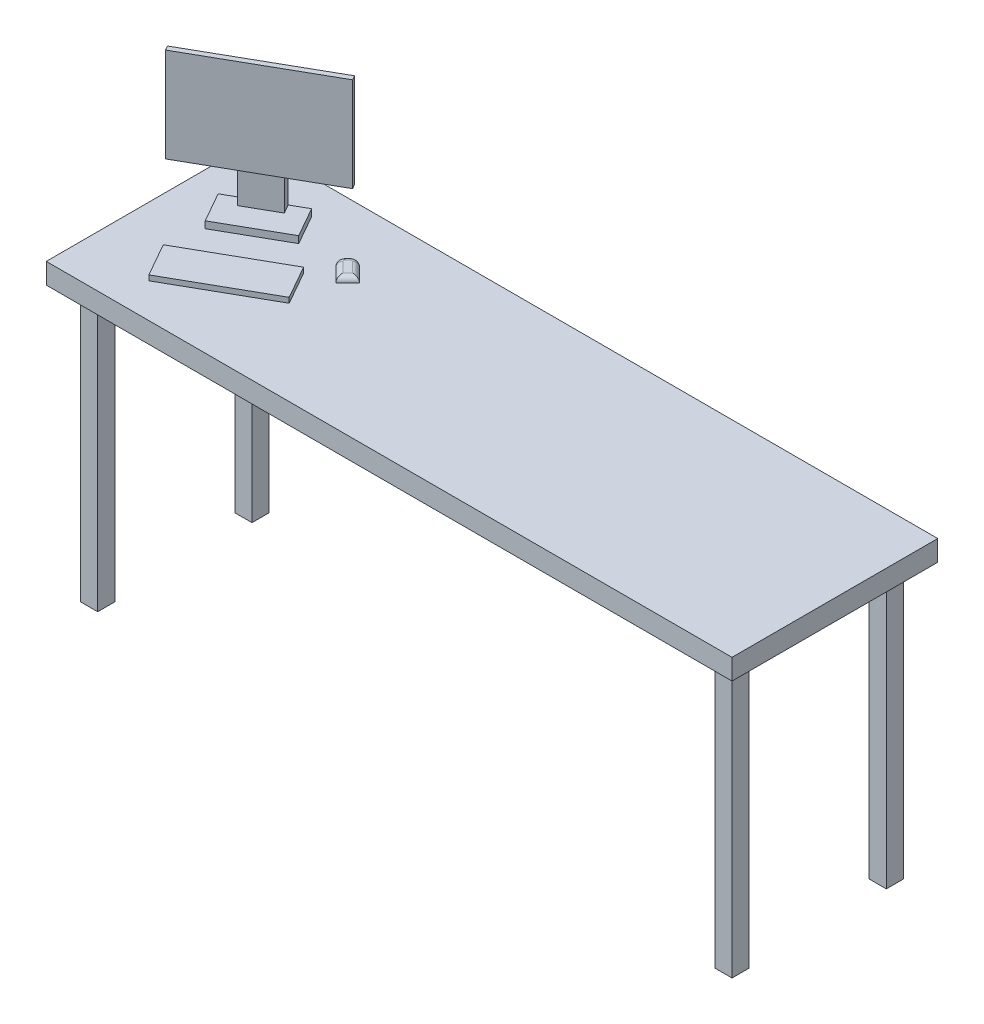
ISO-10303-21;
HEADER;
FILE_DESCRIPTION(('STEP AP214'),'2;1');
FILE_NAME('part.step','',(''),(''),'','','');
FILE_SCHEMA(('AUTOMOTIVE_DESIGN { 1 0 10303 214 1 1 1 1 }'));
ENDSEC;
DATA;
#1=APPLICATION_CONTEXT('core data for automotive mechanical design processes');
#2=APPLICATION_PROTOCOL_DEFINITION('international standard','automotive_design',2000,#1);
#3=PRODUCT_CONTEXT('',#1,'mechanical');
#4=PRODUCT('Part','Part','',(#3));
#5=PRODUCT_RELATED_PRODUCT_CATEGORY('part','',(#4));
#6=PRODUCT_DEFINITION_FORMATION('','',#4);
#7=PRODUCT_DEFINITION_CONTEXT('part definition',#1,'design');
#8=PRODUCT_DEFINITION('design','',#6,#7);
#9=PRODUCT_DEFINITION_SHAPE('','',#8);
#10=(LENGTH_UNIT() NAMED_UNIT(*) SI_UNIT(.MILLI.,.METRE.));
#11=(NAMED_UNIT(*) PLANE_ANGLE_UNIT() SI_UNIT($,.RADIAN.));
#12=(NAMED_UNIT(*) SI_UNIT($,.STERADIAN.) SOLID_ANGLE_UNIT());
#13=UNCERTAINTY_MEASURE_WITH_UNIT(LENGTH_MEASURE(1.E-05),#10,'distance_accuracy_value','');
#14=(GEOMETRIC_REPRESENTATION_CONTEXT(3) GLOBAL_UNCERTAINTY_ASSIGNED_CONTEXT((#13)) GLOBAL_UNIT_ASSIGNED_CONTEXT((#10,
#11,#12)) REPRESENTATION_CONTEXT('',''));
#15=CARTESIAN_POINT('',(0.,0.,0.));
#16=DIRECTION('',(0.,0.,1.));
#17=DIRECTION('',(1.,0.,0.));
#18=AXIS2_PLACEMENT_3D('',#15,#16,#17);
#19=CARTESIAN_POINT('',(0.,60.,0.));
#20=DIRECTION('',(0.,1.,0.));
#21=DIRECTION('',(0.,0.,1.));
#22=AXIS2_PLACEMENT_3D('',#19,#20,#21);
#23=PLANE('',#22);
#24=DIRECTION('',(0.,0.,1.));
#25=VECTOR('',#24,1.);
#26=CARTESIAN_POINT('',(-1000.,60.,300.));
#27=LINE('',#26,#25);
#28=CARTESIAN_POINT('',(-1000.,60.,-300.));
#29=VERTEX_POINT('',#28);
#30=CARTESIAN_POINT('',(-1000.,60.,300.));
#31=VERTEX_POINT('',#30);
#32=EDGE_CURVE('E1008',#29,#31,#27,.T.);
#33=ORIENTED_EDGE('',*,*,#32,.T.);
#34=DIRECTION('',(1.,0.,0.));
#35=VECTOR('',#34,1.);
#36=CARTESIAN_POINT('',(1000.,60.,300.));
#37=LINE('',#36,#35);
#38=CARTESIAN_POINT('',(1000.,60.,300.));
#39=VERTEX_POINT('',#38);
#40=EDGE_CURVE('E1010',#31,#39,#37,.T.);
#41=ORIENTED_EDGE('',*,*,#40,.T.);
#42=DIRECTION('',(0.,0.,-1.));
#43=VECTOR('',#42,1.);
#44=CARTESIAN_POINT('',(1000.,60.,300.));
#45=LINE('',#44,#43);
#46=CARTESIAN_POINT('',(1000.,60.,-300.));
#47=VERTEX_POINT('',#46);
#48=EDGE_CURVE('E1013',#39,#47,#45,.T.);
#49=ORIENTED_EDGE('',*,*,#48,.T.);
#50=DIRECTION('',(-1.,0.,0.));
#51=VECTOR('',#50,1.);
#52=CARTESIAN_POINT('',(1000.,60.,-300.));
#53=LINE('',#52,#51);
#54=EDGE_CURVE('E1015',#47,#29,#53,.T.);
#55=ORIENTED_EDGE('',*,*,#54,.T.);
#56=EDGE_LOOP('',(#33,#41,#49,#55));
#57=FACE_BOUND('',#56,.T.);
#58=DIRECTION('',(-0.493721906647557,0.,-0.869619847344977));
#59=VECTOR('',#58,1.);
#60=CARTESIAN_POINT('',(-676.703839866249,60.,-113.038015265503));
#61=LINE('',#60,#59);
#62=CARTESIAN_POINT('',(-676.703839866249,60.,-113.038015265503));
#63=VERTEX_POINT('',#62);
#64=CARTESIAN_POINT('',(-726.076030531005,60.,-200.));
#65=VERTEX_POINT('',#64);
#66=EDGE_CURVE('E1052',#63,#65,#61,.T.);
#67=ORIENTED_EDGE('',*,*,#66,.F.);
#68=DIRECTION('',(0.869619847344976,0.,-0.493721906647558));
#69=VECTOR('',#68,1.);
#70=CARTESIAN_POINT('',(-850.627809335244,60.,-14.2936339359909));
#71=LINE('',#70,#69);
#72=CARTESIAN_POINT('',(-850.627809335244,60.,-14.2936339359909));
#73=VERTEX_POINT('',#72);
#74=EDGE_CURVE('E1049',#73,#63,#71,.T.);
#75=ORIENTED_EDGE('',*,*,#74,.F.);
#76=DIRECTION('',(0.493721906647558,0.,0.869619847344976));
#77=VECTOR('',#76,1.);
#78=CARTESIAN_POINT('',(-850.627809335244,60.,-14.2936339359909));
#79=LINE('',#78,#77);
#80=CARTESIAN_POINT('',(-900.,60.,-101.255618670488));
#81=VERTEX_POINT('',#80);
#82=EDGE_CURVE('E1058',#81,#73,#79,.T.);
#83=ORIENTED_EDGE('',*,*,#82,.F.);
#84=DIRECTION('',(-0.869619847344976,0.,0.493721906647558));
#85=VECTOR('',#84,1.);
#86=CARTESIAN_POINT('',(-900.,60.,-101.255618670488));
#87=LINE('',#86,#85);
#88=EDGE_CURVE('E1055',#65,#81,#87,.T.);
#89=ORIENTED_EDGE('',*,*,#88,.F.);
#90=EDGE_LOOP('',(#67,#75,#83,#89));
#91=FACE_BOUND('',#90,.T.);
#92=DIRECTION('',(0.87017204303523,0.,-0.492748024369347));
#93=VECTOR('',#92,1.);
#94=CARTESIAN_POINT('',(-801.28410809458,60.,199.476802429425));
#95=LINE('',#94,#93);
#96=CARTESIAN_POINT('',(-801.28410809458,60.,199.476802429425));
#97=VERTEX_POINT('',#96);
#98=CARTESIAN_POINT('',(-539.98573951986,60.,51.5126660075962));
#99=VERTEX_POINT('',#98);
#100=EDGE_CURVE('E351',#97,#99,#95,.T.);
#101=ORIENTED_EDGE('',*,*,#100,.F.);
#102=DIRECTION('',(0.492748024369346,0.,0.87017204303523));
#103=VECTOR('',#102,1.);
#104=CARTESIAN_POINT('',(-856.303087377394,60.,102.315626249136));
#105=LINE('',#104,#103);
#106=CARTESIAN_POINT('',(-856.303087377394,60.,102.315626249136));
#107=VERTEX_POINT('',#106);
#108=EDGE_CURVE('E337',#107,#97,#105,.T.);
#109=ORIENTED_EDGE('',*,*,#108,.F.);
#110=DIRECTION('',(-0.87017204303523,0.,0.492748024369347));
#111=VECTOR('',#110,1.);
#112=CARTESIAN_POINT('',(-856.303087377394,60.,102.315626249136));
#113=LINE('',#112,#111);
#114=CARTESIAN_POINT('',(-595.004718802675,60.,-45.6485101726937));
#115=VERTEX_POINT('',#114);
#116=EDGE_CURVE('E342',#115,#107,#113,.T.);
#117=ORIENTED_EDGE('',*,*,#116,.F.);
#118=DIRECTION('',(-0.492748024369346,0.,-0.87017204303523));
#119=VECTOR('',#118,1.);
#120=CARTESIAN_POINT('',(-595.004718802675,60.,-45.6485101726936));
#121=LINE('',#120,#119);
#122=EDGE_CURVE('E353',#99,#115,#121,.T.);
#123=ORIENTED_EDGE('',*,*,#122,.F.);
#124=EDGE_LOOP('',(#101,#109,#117,#123));
#125=FACE_BOUND('',#124,.T.);
#126=DIRECTION('',(0.707106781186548,0.,-0.707106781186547));
#127=VECTOR('',#126,1.);
#128=CARTESIAN_POINT('',(-523.424285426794,60.,-67.7929044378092));
#129=LINE('',#128,#127);
#130=CARTESIAN_POINT('',(-523.424285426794,60.,-67.7929044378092));
#131=VERTEX_POINT('',#130);
#132=CARTESIAN_POINT('',(-488.739543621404,60.,-102.477646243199));
#133=VERTEX_POINT('',#132);
#134=EDGE_CURVE('E316',#131,#133,#129,.T.);
#135=ORIENTED_EDGE('',*,*,#134,.F.);
#136=DIRECTION('',(0.707106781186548,0.,0.707106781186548));
#137=VECTOR('',#136,1.);
#138=CARTESIAN_POINT('',(-577.027977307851,60.,-121.396596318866));
#139=LINE('',#138,#137);
#140=CARTESIAN_POINT('',(-562.88584168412,60.,-107.254460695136));
#141=VERTEX_POINT('',#140);
#142=EDGE_CURVE('E323',#141,#131,#139,.T.);
#143=ORIENTED_EDGE('',*,*,#142,.F.);
#144=CARTESIAN_POINT('',(-548.74370606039,60.,-121.396596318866));
#145=DIRECTION('',(0.,1.,0.));
#146=DIRECTION('',(0.,0.,1.));
#147=AXIS2_PLACEMENT_3D('',#144,#145,#146);
#148=CIRCLE('',#147,20.);
#149=CARTESIAN_POINT('',(-562.88584168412,60.,-135.538731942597));
#150=VERTEX_POINT('',#149);
#151=EDGE_CURVE('E433',#141,#150,#148,.F.);
#152=ORIENTED_EDGE('',*,*,#151,.T.);
#153=DIRECTION('',(-0.707106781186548,0.,0.707106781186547));
#154=VECTOR('',#153,1.);
#155=CARTESIAN_POINT('',(-577.027977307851,60.,-121.396596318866));
#156=LINE('',#155,#154);
#157=CARTESIAN_POINT('',(-556.485371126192,60.,-141.939202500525));
#158=VERTEX_POINT('',#157);
#159=EDGE_CURVE('E332',#158,#150,#156,.T.);
#160=ORIENTED_EDGE('',*,*,#159,.F.);
#161=CARTESIAN_POINT('',(-542.343235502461,60.,-127.797066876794));
#162=DIRECTION('',(0.,1.,0.));
#163=DIRECTION('',(0.,0.,1.));
#164=AXIS2_PLACEMENT_3D('',#161,#162,#163);
#165=CIRCLE('',#164,20.);
#166=CARTESIAN_POINT('',(-528.20109987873,60.,-141.939202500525));
#167=VERTEX_POINT('',#166);
#168=EDGE_CURVE('E431',#158,#167,#165,.F.);
#169=ORIENTED_EDGE('',*,*,#168,.T.);
#170=DIRECTION('',(-0.707106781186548,0.,-0.707106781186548));
#171=VECTOR('',#170,1.);
#172=CARTESIAN_POINT('',(-542.343235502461,60.,-156.081338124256));
#173=LINE('',#172,#171);
#174=EDGE_CURVE('E330',#133,#167,#173,.T.);
#175=ORIENTED_EDGE('',*,*,#174,.F.);
#176=EDGE_LOOP('',(#135,#143,#152,#160,#169,#175));
#177=FACE_BOUND('',#176,.T.);
#178=ADVANCED_FACE('F37',(#57,#91,#125,#177),#23,.T.);
#179=CARTESIAN_POINT('',(-841.707350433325,280.,-99.8531185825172));
#180=DIRECTION('',(-0.493721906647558,0.,-0.869619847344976));
#181=DIRECTION('',(-0.869619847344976,0.,0.493721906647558));
#182=AXIS2_PLACEMENT_3D('',#179,#180,#181);
#183=PLANE('',#182);
#184=DIRECTION('',(0.869619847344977,0.,-0.493721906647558));
#185=VECTOR('',#184,1.);
#186=CARTESIAN_POINT('',(-972.150327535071,180.,-25.7948325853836));
#187=LINE('',#186,#185);
#188=CARTESIAN_POINT('',(-841.707350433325,180.,-99.8531185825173));
#189=VERTEX_POINT('',#188);
#190=CARTESIAN_POINT('',(-754.745365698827,180.,-149.225309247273));
#191=VERTEX_POINT('',#190);
#192=EDGE_CURVE('E385',#189,#191,#187,.T.);
#193=ORIENTED_EDGE('',*,*,#192,.F.);
#194=DIRECTION('',(0.,-1.,0.));
#195=VECTOR('',#194,1.);
#196=CARTESIAN_POINT('',(-841.707350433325,280.,-99.8531185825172));
#197=LINE('',#196,#195);
#198=CARTESIAN_POINT('',(-841.707350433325,80.,-99.8531185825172));
#199=VERTEX_POINT('',#198);
#200=EDGE_CURVE('E1230',#189,#199,#197,.T.);
#201=ORIENTED_EDGE('',*,*,#200,.T.);
#202=DIRECTION('',(0.869619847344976,0.,-0.493721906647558));
#203=VECTOR('',#202,1.);
#204=CARTESIAN_POINT('',(-841.707350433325,80.,-99.8531185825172));
#205=LINE('',#204,#203);
#206=CARTESIAN_POINT('',(-754.745365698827,80.,-149.225309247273));
#207=VERTEX_POINT('',#206);
#208=EDGE_CURVE('E412',#199,#207,#205,.T.);
#209=ORIENTED_EDGE('',*,*,#208,.T.);
#210=DIRECTION('',(0.,-1.,0.));
#211=VECTOR('',#210,1.);
#212=CARTESIAN_POINT('',(-754.745365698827,280.,-149.225309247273));
#213=LINE('',#212,#211);
#214=EDGE_CURVE('E428',#191,#207,#213,.T.);
#215=ORIENTED_EDGE('',*,*,#214,.F.);
#216=EDGE_LOOP('',(#193,#201,#209,#215));
#217=FACE_BOUND('',#216,.T.);
#218=ADVANCED_FACE('F476',(#217),#183,.F.);
#219=CARTESIAN_POINT('',(0.,0.,0.));
#220=DIRECTION('',(0.,1.,0.));
#221=DIRECTION('',(0.,0.,1.));
#222=AXIS2_PLACEMENT_3D('',#219,#220,#221);
#223=PLANE('',#222);
#224=DIRECTION('',(1.,0.,0.));
#225=VECTOR('',#224,1.);
#226=CARTESIAN_POINT('',(-950.,0.,-200.));
#227=LINE('',#226,#225);
#228=CARTESIAN_POINT('',(-950.,0.,-200.));
#229=VERTEX_POINT('',#228);
#230=CARTESIAN_POINT('',(-900.,0.,-200.));
#231=VERTEX_POINT('',#230);
#232=EDGE_CURVE('E1087',#229,#231,#227,.T.);
#233=ORIENTED_EDGE('',*,*,#232,.T.);
#234=DIRECTION('',(0.,0.,-1.));
#235=VECTOR('',#234,1.);
#236=CARTESIAN_POINT('',(-900.,0.,-250.));
#237=LINE('',#236,#235);
#238=CARTESIAN_POINT('',(-900.,0.,-250.));
#239=VERTEX_POINT('',#238);
#240=EDGE_CURVE('E1070',#231,#239,#237,.T.);
#241=ORIENTED_EDGE('',*,*,#240,.T.);
#242=DIRECTION('',(-1.,0.,0.));
#243=VECTOR('',#242,1.);
#244=CARTESIAN_POINT('',(-950.,0.,-250.));
#245=LINE('',#244,#243);
#246=CARTESIAN_POINT('',(-950.,0.,-250.));
#247=VERTEX_POINT('',#246);
#248=EDGE_CURVE('E1075',#239,#247,#245,.T.);
#249=ORIENTED_EDGE('',*,*,#248,.T.);
#250=DIRECTION('',(0.,0.,1.));
#251=VECTOR('',#250,1.);
#252=CARTESIAN_POINT('',(-950.,0.,-250.));
#253=LINE('',#252,#251);
#254=EDGE_CURVE('E1090',#247,#229,#253,.T.);
#255=ORIENTED_EDGE('',*,*,#254,.T.);
#256=EDGE_LOOP('',(#233,#241,#249,#255));
#257=FACE_BOUND('',#256,.T.);
#258=DIRECTION('',(0.,0.,1.));
#259=VECTOR('',#258,1.);
#260=CARTESIAN_POINT('',(-900.,0.,250.));
#261=LINE('',#260,#259);
#262=CARTESIAN_POINT('',(-900.,0.,200.));
#263=VERTEX_POINT('',#262);
#264=CARTESIAN_POINT('',(-900.,0.,250.));
#265=VERTEX_POINT('',#264);
#266=EDGE_CURVE('E974',#263,#265,#261,.T.);
#267=ORIENTED_EDGE('',*,*,#266,.F.);
#268=DIRECTION('',(1.,0.,0.));
#269=VECTOR('',#268,1.);
#270=CARTESIAN_POINT('',(-950.,0.,200.));
#271=LINE('',#270,#269);
#272=CARTESIAN_POINT('',(-950.,0.,200.));
#273=VERTEX_POINT('',#272);
#274=EDGE_CURVE('E996',#273,#263,#271,.T.);
#275=ORIENTED_EDGE('',*,*,#274,.F.);
#276=DIRECTION('',(0.,0.,-1.));
#277=VECTOR('',#276,1.);
#278=CARTESIAN_POINT('',(-950.,0.,250.));
#279=LINE('',#278,#277);
#280=CARTESIAN_POINT('',(-950.,0.,250.));
#281=VERTEX_POINT('',#280);
#282=EDGE_CURVE('E986',#281,#273,#279,.T.);
#283=ORIENTED_EDGE('',*,*,#282,.F.);
#284=DIRECTION('',(-1.,0.,0.));
#285=VECTOR('',#284,1.);
#286=CARTESIAN_POINT('',(-950.,0.,250.));
#287=LINE('',#286,#285);
#288=EDGE_CURVE('E982',#265,#281,#287,.T.);
#289=ORIENTED_EDGE('',*,*,#288,.F.);
#290=EDGE_LOOP('',(#267,#275,#283,#289));
#291=FACE_BOUND('',#290,.T.);
#292=DIRECTION('',(0.,0.,1.));
#293=VECTOR('',#292,1.);
#294=CARTESIAN_POINT('',(-1000.,0.,300.));
#295=LINE('',#294,#293);
#296=CARTESIAN_POINT('',(-1000.,0.,-300.));
#297=VERTEX_POINT('',#296);
#298=CARTESIAN_POINT('',(-1000.,0.,300.));
#299=VERTEX_POINT('',#298);
#300=EDGE_CURVE('E1007',#297,#299,#295,.T.);
#301=ORIENTED_EDGE('',*,*,#300,.F.);
#302=DIRECTION('',(-1.,0.,0.));
#303=VECTOR('',#302,1.);
#304=CARTESIAN_POINT('',(1000.,0.,-300.));
#305=LINE('',#304,#303);
#306=CARTESIAN_POINT('',(1000.,0.,-300.));
#307=VERTEX_POINT('',#306);
#308=EDGE_CURVE('E1011',#307,#297,#305,.T.);
#309=ORIENTED_EDGE('',*,*,#308,.F.);
#310=DIRECTION('',(0.,0.,-1.));
#311=VECTOR('',#310,1.);
#312=CARTESIAN_POINT('',(1000.,0.,300.));
#313=LINE('',#312,#311);
#314=CARTESIAN_POINT('',(1000.,0.,300.));
#315=VERTEX_POINT('',#314);
#316=EDGE_CURVE('E1022',#315,#307,#313,.T.);
#317=ORIENTED_EDGE('',*,*,#316,.F.);
#318=DIRECTION('',(1.,0.,0.));
#319=VECTOR('',#318,1.);
#320=CARTESIAN_POINT('',(1000.,0.,300.));
#321=LINE('',#320,#319);
#322=EDGE_CURVE('E1020',#299,#315,#321,.T.);
#323=ORIENTED_EDGE('',*,*,#322,.F.);
#324=EDGE_LOOP('',(#301,#309,#317,#323));
#325=FACE_BOUND('',#324,.T.);
#326=DIRECTION('',(-1.,0.,0.));
#327=VECTOR('',#326,1.);
#328=CARTESIAN_POINT('',(950.,0.,200.));
#329=LINE('',#328,#327);
#330=CARTESIAN_POINT('',(950.,0.,200.));
#331=VERTEX_POINT('',#330);
#332=CARTESIAN_POINT('',(900.,0.,200.));
#333=VERTEX_POINT('',#332);
#334=EDGE_CURVE('E1153',#331,#333,#329,.T.);
#335=ORIENTED_EDGE('',*,*,#334,.T.);
#336=DIRECTION('',(0.,0.,1.));
#337=VECTOR('',#336,1.);
#338=CARTESIAN_POINT('',(900.,0.,250.));
#339=LINE('',#338,#337);
#340=CARTESIAN_POINT('',(900.,0.,250.));
#341=VERTEX_POINT('',#340);
#342=EDGE_CURVE('E1136',#333,#341,#339,.T.);
#343=ORIENTED_EDGE('',*,*,#342,.T.);
#344=DIRECTION('',(1.,0.,0.));
#345=VECTOR('',#344,1.);
#346=CARTESIAN_POINT('',(950.,0.,250.));
#347=LINE('',#346,#345);
#348=CARTESIAN_POINT('',(950.,0.,250.));
#349=VERTEX_POINT('',#348);
#350=EDGE_CURVE('E1141',#341,#349,#347,.T.);
#351=ORIENTED_EDGE('',*,*,#350,.T.);
#352=DIRECTION('',(0.,0.,-1.));
#353=VECTOR('',#352,1.);
#354=CARTESIAN_POINT('',(950.,0.,250.));
#355=LINE('',#354,#353);
#356=EDGE_CURVE('E1156',#349,#331,#355,.T.);
#357=ORIENTED_EDGE('',*,*,#356,.T.);
#358=EDGE_LOOP('',(#335,#343,#351,#357));
#359=FACE_BOUND('',#358,.T.);
#360=DIRECTION('',(0.,0.,-1.));
#361=VECTOR('',#360,1.);
#362=CARTESIAN_POINT('',(900.,0.,-250.));
#363=LINE('',#362,#361);
#364=CARTESIAN_POINT('',(900.,0.,-200.));
#365=VERTEX_POINT('',#364);
#366=CARTESIAN_POINT('',(900.,0.,-250.));
#367=VERTEX_POINT('',#366);
#368=EDGE_CURVE('E1103',#365,#367,#363,.T.);
#369=ORIENTED_EDGE('',*,*,#368,.F.);
#370=DIRECTION('',(-1.,0.,0.));
#371=VECTOR('',#370,1.);
#372=CARTESIAN_POINT('',(950.,0.,-200.));
#373=LINE('',#372,#371);
#374=CARTESIAN_POINT('',(950.,0.,-200.));
#375=VERTEX_POINT('',#374);
#376=EDGE_CURVE('E1108',#375,#365,#373,.T.);
#377=ORIENTED_EDGE('',*,*,#376,.F.);
#378=DIRECTION('',(0.,0.,1.));
#379=VECTOR('',#378,1.);
#380=CARTESIAN_POINT('',(950.,0.,-250.));
#381=LINE('',#380,#379);
#382=CARTESIAN_POINT('',(950.,0.,-250.));
#383=VERTEX_POINT('',#382);
#384=EDGE_CURVE('E1120',#383,#375,#381,.T.);
#385=ORIENTED_EDGE('',*,*,#384,.F.);
#386=DIRECTION('',(1.,0.,0.));
#387=VECTOR('',#386,1.);
#388=CARTESIAN_POINT('',(950.,0.,-250.));
#389=LINE('',#388,#387);
#390=EDGE_CURVE('E1117',#367,#383,#389,.T.);
#391=ORIENTED_EDGE('',*,*,#390,.F.);
#392=EDGE_LOOP('',(#369,#377,#385,#391));
#393=FACE_BOUND('',#392,.T.);
#394=ADVANCED_FACE('F482',(#257,#291,#325,#359,#393),#223,.F.);
#395=CARTESIAN_POINT('',(-1000.,60.,300.));
#396=DIRECTION('',(1.,0.,0.));
#397=DIRECTION('',(0.,0.,-1.));
#398=AXIS2_PLACEMENT_3D('',#395,#396,#397);
#399=PLANE('',#398);
#400=ORIENTED_EDGE('',*,*,#300,.T.);
#401=DIRECTION('',(0.,-1.,0.));
#402=VECTOR('',#401,1.);
#403=CARTESIAN_POINT('',(-1000.,60.,300.));
#404=LINE('',#403,#402);
#405=EDGE_CURVE('E434',#31,#299,#404,.T.);
#406=ORIENTED_EDGE('',*,*,#405,.F.);
#407=ORIENTED_EDGE('',*,*,#32,.F.);
#408=DIRECTION('',(0.,-1.,0.));
#409=VECTOR('',#408,1.);
#410=CARTESIAN_POINT('',(-1000.,60.,-300.));
#411=LINE('',#410,#409);
#412=EDGE_CURVE('E1017',#29,#297,#411,.T.);
#413=ORIENTED_EDGE('',*,*,#412,.T.);
#414=EDGE_LOOP('',(#400,#406,#407,#413));
#415=FACE_BOUND('',#414,.T.);
#416=ADVANCED_FACE('F493',(#415),#399,.F.);
#417=CARTESIAN_POINT('',(1000.,60.,300.));
#418=DIRECTION('',(0.,0.,-1.));
#419=DIRECTION('',(-1.,0.,0.));
#420=AXIS2_PLACEMENT_3D('',#417,#418,#419);
#421=PLANE('',#420);
#422=ORIENTED_EDGE('',*,*,#322,.T.);
#423=DIRECTION('',(0.,-1.,0.));
#424=VECTOR('',#423,1.);
#425=CARTESIAN_POINT('',(1000.,60.,300.));
#426=LINE('',#425,#424);
#427=EDGE_CURVE('E1030',#39,#315,#426,.T.);
#428=ORIENTED_EDGE('',*,*,#427,.F.);
#429=ORIENTED_EDGE('',*,*,#40,.F.);
#430=ORIENTED_EDGE('',*,*,#405,.T.);
#431=EDGE_LOOP('',(#422,#428,#429,#430));
#432=FACE_BOUND('',#431,.T.);
#433=ADVANCED_FACE('F502',(#432),#421,.F.);
#434=CARTESIAN_POINT('',(1000.,60.,300.));
#435=DIRECTION('',(-1.,0.,0.));
#436=DIRECTION('',(0.,0.,1.));
#437=AXIS2_PLACEMENT_3D('',#434,#435,#436);
#438=PLANE('',#437);
#439=ORIENTED_EDGE('',*,*,#316,.T.);
#440=DIRECTION('',(0.,-1.,0.));
#441=VECTOR('',#440,1.);
#442=CARTESIAN_POINT('',(1000.,60.,-300.));
#443=LINE('',#442,#441);
#444=EDGE_CURVE('E1027',#47,#307,#443,.T.);
#445=ORIENTED_EDGE('',*,*,#444,.F.);
#446=ORIENTED_EDGE('',*,*,#48,.F.);
#447=ORIENTED_EDGE('',*,*,#427,.T.);
#448=EDGE_LOOP('',(#439,#445,#446,#447));
#449=FACE_BOUND('',#448,.T.);
#450=ADVANCED_FACE('F498',(#449),#438,.F.);
#451=CARTESIAN_POINT('',(1000.,60.,-300.));
#452=DIRECTION('',(0.,0.,1.));
#453=DIRECTION('',(1.,0.,0.));
#454=AXIS2_PLACEMENT_3D('',#451,#452,#453);
#455=PLANE('',#454);
#456=ORIENTED_EDGE('',*,*,#308,.T.);
#457=ORIENTED_EDGE('',*,*,#412,.F.);
#458=ORIENTED_EDGE('',*,*,#54,.F.);
#459=ORIENTED_EDGE('',*,*,#444,.T.);
#460=EDGE_LOOP('',(#456,#457,#458,#459));
#461=FACE_BOUND('',#460,.T.);
#462=ADVANCED_FACE('F495',(#461),#455,.F.);
#463=CARTESIAN_POINT('',(-900.,-800.,250.));
#464=DIRECTION('',(-1.,0.,0.));
#465=DIRECTION('',(0.,0.,1.));
#466=AXIS2_PLACEMENT_3D('',#463,#464,#465);
#467=PLANE('',#466);
#468=ORIENTED_EDGE('',*,*,#266,.T.);
#469=DIRECTION('',(0.,1.,0.));
#470=VECTOR('',#469,1.);
#471=CARTESIAN_POINT('',(-900.,-800.,250.));
#472=LINE('',#471,#470);
#473=CARTESIAN_POINT('',(-900.,-800.,250.));
#474=VERTEX_POINT('',#473);
#475=EDGE_CURVE('E977',#474,#265,#472,.T.);
#476=ORIENTED_EDGE('',*,*,#475,.F.);
#477=DIRECTION('',(0.,0.,1.));
#478=VECTOR('',#477,1.);
#479=CARTESIAN_POINT('',(-900.,-800.,250.));
#480=LINE('',#479,#478);
#481=CARTESIAN_POINT('',(-900.,-800.,200.));
#482=VERTEX_POINT('',#481);
#483=EDGE_CURVE('E998',#482,#474,#480,.T.);
#484=ORIENTED_EDGE('',*,*,#483,.F.);
#485=DIRECTION('',(0.,1.,0.));
#486=VECTOR('',#485,1.);
#487=CARTESIAN_POINT('',(-900.,-800.,200.));
#488=LINE('',#487,#486);
#489=EDGE_CURVE('E979',#482,#263,#488,.T.);
#490=ORIENTED_EDGE('',*,*,#489,.T.);
#491=EDGE_LOOP('',(#468,#476,#484,#490));
#492=FACE_BOUND('',#491,.T.);
#493=ADVANCED_FACE('F489',(#492),#467,.F.);
#494=CARTESIAN_POINT('',(-950.,-800.,250.));
#495=DIRECTION('',(0.,0.,-1.));
#496=DIRECTION('',(-1.,0.,0.));
#497=AXIS2_PLACEMENT_3D('',#494,#495,#496);
#498=PLANE('',#497);
#499=ORIENTED_EDGE('',*,*,#288,.T.);
#500=DIRECTION('',(0.,1.,0.));
#501=VECTOR('',#500,1.);
#502=CARTESIAN_POINT('',(-950.,-800.,250.));
#503=LINE('',#502,#501);
#504=CARTESIAN_POINT('',(-950.,-800.,250.));
#505=VERTEX_POINT('',#504);
#506=EDGE_CURVE('E1003',#505,#281,#503,.T.);
#507=ORIENTED_EDGE('',*,*,#506,.F.);
#508=DIRECTION('',(-1.,0.,0.));
#509=VECTOR('',#508,1.);
#510=CARTESIAN_POINT('',(-950.,-800.,250.));
#511=LINE('',#510,#509);
#512=EDGE_CURVE('E1168',#474,#505,#511,.T.);
#513=ORIENTED_EDGE('',*,*,#512,.F.);
#514=ORIENTED_EDGE('',*,*,#475,.T.);
#515=EDGE_LOOP('',(#499,#507,#513,#514));
#516=FACE_BOUND('',#515,.T.);
#517=ADVANCED_FACE('F926',(#516),#498,.F.);
#518=CARTESIAN_POINT('',(-950.,-800.,250.));
#519=DIRECTION('',(1.,0.,0.));
#520=DIRECTION('',(0.,0.,-1.));
#521=AXIS2_PLACEMENT_3D('',#518,#519,#520);
#522=PLANE('',#521);
#523=ORIENTED_EDGE('',*,*,#282,.T.);
#524=DIRECTION('',(0.,1.,0.));
#525=VECTOR('',#524,1.);
#526=CARTESIAN_POINT('',(-950.,-800.,200.));
#527=LINE('',#526,#525);
#528=CARTESIAN_POINT('',(-950.,-800.,200.));
#529=VERTEX_POINT('',#528);
#530=EDGE_CURVE('E1000',#529,#273,#527,.T.);
#531=ORIENTED_EDGE('',*,*,#530,.F.);
#532=DIRECTION('',(0.,0.,-1.));
#533=VECTOR('',#532,1.);
#534=CARTESIAN_POINT('',(-950.,-800.,250.));
#535=LINE('',#534,#533);
#536=EDGE_CURVE('E1169',#505,#529,#535,.T.);
#537=ORIENTED_EDGE('',*,*,#536,.F.);
#538=ORIENTED_EDGE('',*,*,#506,.T.);
#539=EDGE_LOOP('',(#523,#531,#537,#538));
#540=FACE_BOUND('',#539,.T.);
#541=ADVANCED_FACE('F916',(#540),#522,.F.);
#542=CARTESIAN_POINT('',(-950.,-800.,200.));
#543=DIRECTION('',(0.,0.,1.));
#544=DIRECTION('',(1.,0.,0.));
#545=AXIS2_PLACEMENT_3D('',#542,#543,#544);
#546=PLANE('',#545);
#547=ORIENTED_EDGE('',*,*,#274,.T.);
#548=ORIENTED_EDGE('',*,*,#489,.F.);
#549=DIRECTION('',(1.,0.,0.));
#550=VECTOR('',#549,1.);
#551=CARTESIAN_POINT('',(-950.,-800.,200.));
#552=LINE('',#551,#550);
#553=EDGE_CURVE('E991',#529,#482,#552,.T.);
#554=ORIENTED_EDGE('',*,*,#553,.F.);
#555=ORIENTED_EDGE('',*,*,#530,.T.);
#556=EDGE_LOOP('',(#547,#548,#554,#555));
#557=FACE_BOUND('',#556,.T.);
#558=ADVANCED_FACE('F906',(#557),#546,.F.);
#559=CARTESIAN_POINT('',(0.,-800.,0.));
#560=DIRECTION('',(0.,-1.,0.));
#561=DIRECTION('',(0.,0.,-1.));
#562=AXIS2_PLACEMENT_3D('',#559,#560,#561);
#563=PLANE('',#562);
#564=ORIENTED_EDGE('',*,*,#483,.T.);
#565=ORIENTED_EDGE('',*,*,#512,.T.);
#566=ORIENTED_EDGE('',*,*,#536,.T.);
#567=ORIENTED_EDGE('',*,*,#553,.T.);
#568=EDGE_LOOP('',(#564,#565,#566,#567));
#569=FACE_BOUND('',#568,.T.);
#570=ADVANCED_FACE('F896',(#569),#563,.T.);
#571=CARTESIAN_POINT('',(900.,-800.,250.));
#572=DIRECTION('',(-1.,0.,0.));
#573=DIRECTION('',(0.,0.,1.));
#574=AXIS2_PLACEMENT_3D('',#571,#572,#573);
#575=PLANE('',#574);
#576=ORIENTED_EDGE('',*,*,#342,.F.);
#577=DIRECTION('',(0.,1.,0.));
#578=VECTOR('',#577,1.);
#579=CARTESIAN_POINT('',(900.,-800.,200.));
#580=LINE('',#579,#578);
#581=CARTESIAN_POINT('',(900.,-800.,200.));
#582=VERTEX_POINT('',#581);
#583=EDGE_CURVE('E983',#582,#333,#580,.T.);
#584=ORIENTED_EDGE('',*,*,#583,.F.);
#585=DIRECTION('',(0.,0.,1.));
#586=VECTOR('',#585,1.);
#587=CARTESIAN_POINT('',(900.,-800.,250.));
#588=LINE('',#587,#586);
#589=CARTESIAN_POINT('',(900.,-800.,250.));
#590=VERTEX_POINT('',#589);
#591=EDGE_CURVE('E1137',#582,#590,#588,.T.);
#592=ORIENTED_EDGE('',*,*,#591,.T.);
#593=DIRECTION('',(0.,1.,0.));
#594=VECTOR('',#593,1.);
#595=CARTESIAN_POINT('',(900.,-800.,250.));
#596=LINE('',#595,#594);
#597=EDGE_CURVE('E1150',#590,#341,#596,.T.);
#598=ORIENTED_EDGE('',*,*,#597,.T.);
#599=EDGE_LOOP('',(#576,#584,#592,#598));
#600=FACE_BOUND('',#599,.T.);
#601=ADVANCED_FACE('F886',(#600),#575,.T.);
#602=CARTESIAN_POINT('',(950.,-800.,200.));
#603=DIRECTION('',(0.,0.,-1.));
#604=DIRECTION('',(-1.,0.,0.));
#605=AXIS2_PLACEMENT_3D('',#602,#603,#604);
#606=PLANE('',#605);
#607=ORIENTED_EDGE('',*,*,#334,.F.);
#608=DIRECTION('',(0.,1.,0.));
#609=VECTOR('',#608,1.);
#610=CARTESIAN_POINT('',(950.,-800.,200.));
#611=LINE('',#610,#609);
#612=CARTESIAN_POINT('',(950.,-800.,200.));
#613=VERTEX_POINT('',#612);
#614=EDGE_CURVE('E988',#613,#331,#611,.T.);
#615=ORIENTED_EDGE('',*,*,#614,.F.);
#616=DIRECTION('',(-1.,0.,0.));
#617=VECTOR('',#616,1.);
#618=CARTESIAN_POINT('',(950.,-800.,200.));
#619=LINE('',#618,#617);
#620=EDGE_CURVE('E1140',#613,#582,#619,.T.);
#621=ORIENTED_EDGE('',*,*,#620,.T.);
#622=ORIENTED_EDGE('',*,*,#583,.T.);
#623=EDGE_LOOP('',(#607,#615,#621,#622));
#624=FACE_BOUND('',#623,.T.);
#625=ADVANCED_FACE('F876',(#624),#606,.T.);
#626=CARTESIAN_POINT('',(950.,-800.,250.));
#627=DIRECTION('',(1.,0.,0.));
#628=DIRECTION('',(0.,0.,-1.));
#629=AXIS2_PLACEMENT_3D('',#626,#627,#628);
#630=PLANE('',#629);
#631=ORIENTED_EDGE('',*,*,#356,.F.);
#632=DIRECTION('',(0.,1.,0.));
#633=VECTOR('',#632,1.);
#634=CARTESIAN_POINT('',(950.,-800.,250.));
#635=LINE('',#634,#633);
#636=CARTESIAN_POINT('',(950.,-800.,250.));
#637=VERTEX_POINT('',#636);
#638=EDGE_CURVE('E1162',#637,#349,#635,.T.);
#639=ORIENTED_EDGE('',*,*,#638,.F.);
#640=DIRECTION('',(0.,0.,-1.));
#641=VECTOR('',#640,1.);
#642=CARTESIAN_POINT('',(950.,-800.,250.));
#643=LINE('',#642,#641);
#644=EDGE_CURVE('E1144',#637,#613,#643,.T.);
#645=ORIENTED_EDGE('',*,*,#644,.T.);
#646=ORIENTED_EDGE('',*,*,#614,.T.);
#647=EDGE_LOOP('',(#631,#639,#645,#646));
#648=FACE_BOUND('',#647,.T.);
#649=ADVANCED_FACE('F866',(#648),#630,.T.);
#650=CARTESIAN_POINT('',(950.,-800.,250.));
#651=DIRECTION('',(0.,0.,1.));
#652=DIRECTION('',(1.,0.,0.));
#653=AXIS2_PLACEMENT_3D('',#650,#651,#652);
#654=PLANE('',#653);
#655=ORIENTED_EDGE('',*,*,#350,.F.);
#656=ORIENTED_EDGE('',*,*,#597,.F.);
#657=DIRECTION('',(1.,0.,0.));
#658=VECTOR('',#657,1.);
#659=CARTESIAN_POINT('',(950.,-800.,250.));
#660=LINE('',#659,#658);
#661=EDGE_CURVE('E1147',#590,#637,#660,.T.);
#662=ORIENTED_EDGE('',*,*,#661,.T.);
#663=ORIENTED_EDGE('',*,*,#638,.T.);
#664=EDGE_LOOP('',(#655,#656,#662,#663));
#665=FACE_BOUND('',#664,.T.);
#666=ADVANCED_FACE('F856',(#665),#654,.T.);
#667=CARTESIAN_POINT('',(0.,-800.,0.));
#668=DIRECTION('',(0.,-1.,0.));
#669=DIRECTION('',(0.,0.,-1.));
#670=AXIS2_PLACEMENT_3D('',#667,#668,#669);
#671=PLANE('',#670);
#672=ORIENTED_EDGE('',*,*,#591,.F.);
#673=ORIENTED_EDGE('',*,*,#620,.F.);
#674=ORIENTED_EDGE('',*,*,#644,.F.);
#675=ORIENTED_EDGE('',*,*,#661,.F.);
#676=EDGE_LOOP('',(#672,#673,#674,#675));
#677=FACE_BOUND('',#676,.T.);
#678=ADVANCED_FACE('F840',(#677),#671,.T.);
#679=CARTESIAN_POINT('',(900.,-800.,-250.));
#680=DIRECTION('',(1.,0.,0.));
#681=DIRECTION('',(0.,0.,-1.));
#682=AXIS2_PLACEMENT_3D('',#679,#680,#681);
#683=PLANE('',#682);
#684=ORIENTED_EDGE('',*,*,#368,.T.);
#685=DIRECTION('',(0.,1.,0.));
#686=VECTOR('',#685,1.);
#687=CARTESIAN_POINT('',(900.,-800.,-250.));
#688=LINE('',#687,#686);
#689=CARTESIAN_POINT('',(900.,-800.,-250.));
#690=VERTEX_POINT('',#689);
#691=EDGE_CURVE('E1133',#690,#367,#688,.T.);
#692=ORIENTED_EDGE('',*,*,#691,.F.);
#693=DIRECTION('',(0.,0.,-1.));
#694=VECTOR('',#693,1.);
#695=CARTESIAN_POINT('',(900.,-800.,-250.));
#696=LINE('',#695,#694);
#697=CARTESIAN_POINT('',(900.,-800.,-200.));
#698=VERTEX_POINT('',#697);
#699=EDGE_CURVE('E1104',#698,#690,#696,.T.);
#700=ORIENTED_EDGE('',*,*,#699,.F.);
#701=DIRECTION('',(0.,1.,0.));
#702=VECTOR('',#701,1.);
#703=CARTESIAN_POINT('',(900.,-800.,-200.));
#704=LINE('',#703,#702);
#705=EDGE_CURVE('E1114',#698,#365,#704,.T.);
#706=ORIENTED_EDGE('',*,*,#705,.T.);
#707=EDGE_LOOP('',(#684,#692,#700,#706));
#708=FACE_BOUND('',#707,.T.);
#709=ADVANCED_FACE('F830',(#708),#683,.F.);
#710=CARTESIAN_POINT('',(950.,-800.,-250.));
#711=DIRECTION('',(0.,0.,1.));
#712=DIRECTION('',(1.,0.,0.));
#713=AXIS2_PLACEMENT_3D('',#710,#711,#712);
#714=PLANE('',#713);
#715=ORIENTED_EDGE('',*,*,#390,.T.);
#716=DIRECTION('',(0.,1.,0.));
#717=VECTOR('',#716,1.);
#718=CARTESIAN_POINT('',(950.,-800.,-250.));
#719=LINE('',#718,#717);
#720=CARTESIAN_POINT('',(950.,-800.,-250.));
#721=VERTEX_POINT('',#720);
#722=EDGE_CURVE('E1130',#721,#383,#719,.T.);
#723=ORIENTED_EDGE('',*,*,#722,.F.);
#724=DIRECTION('',(1.,0.,0.));
#725=VECTOR('',#724,1.);
#726=CARTESIAN_POINT('',(950.,-800.,-250.));
#727=LINE('',#726,#725);
#728=EDGE_CURVE('E1107',#690,#721,#727,.T.);
#729=ORIENTED_EDGE('',*,*,#728,.F.);
#730=ORIENTED_EDGE('',*,*,#691,.T.);
#731=EDGE_LOOP('',(#715,#723,#729,#730));
#732=FACE_BOUND('',#731,.T.);
#733=ADVANCED_FACE('F820',(#732),#714,.F.);
#734=CARTESIAN_POINT('',(950.,-800.,-250.));
#735=DIRECTION('',(-1.,0.,0.));
#736=DIRECTION('',(0.,0.,1.));
#737=AXIS2_PLACEMENT_3D('',#734,#735,#736);
#738=PLANE('',#737);
#739=ORIENTED_EDGE('',*,*,#384,.T.);
#740=DIRECTION('',(0.,1.,0.));
#741=VECTOR('',#740,1.);
#742=CARTESIAN_POINT('',(950.,-800.,-200.));
#743=LINE('',#742,#741);
#744=CARTESIAN_POINT('',(950.,-800.,-200.));
#745=VERTEX_POINT('',#744);
#746=EDGE_CURVE('E1127',#745,#375,#743,.T.);
#747=ORIENTED_EDGE('',*,*,#746,.F.);
#748=DIRECTION('',(0.,0.,1.));
#749=VECTOR('',#748,1.);
#750=CARTESIAN_POINT('',(950.,-800.,-250.));
#751=LINE('',#750,#749);
#752=EDGE_CURVE('E1110',#721,#745,#751,.T.);
#753=ORIENTED_EDGE('',*,*,#752,.F.);
#754=ORIENTED_EDGE('',*,*,#722,.T.);
#755=EDGE_LOOP('',(#739,#747,#753,#754));
#756=FACE_BOUND('',#755,.T.);
#757=ADVANCED_FACE('F810',(#756),#738,.F.);
#758=CARTESIAN_POINT('',(950.,-800.,-200.));
#759=DIRECTION('',(0.,0.,-1.));
#760=DIRECTION('',(-1.,0.,0.));
#761=AXIS2_PLACEMENT_3D('',#758,#759,#760);
#762=PLANE('',#761);
#763=ORIENTED_EDGE('',*,*,#376,.T.);
#764=ORIENTED_EDGE('',*,*,#705,.F.);
#765=DIRECTION('',(-1.,0.,0.));
#766=VECTOR('',#765,1.);
#767=CARTESIAN_POINT('',(950.,-800.,-200.));
#768=LINE('',#767,#766);
#769=EDGE_CURVE('E1112',#745,#698,#768,.T.);
#770=ORIENTED_EDGE('',*,*,#769,.F.);
#771=ORIENTED_EDGE('',*,*,#746,.T.);
#772=EDGE_LOOP('',(#763,#764,#770,#771));
#773=FACE_BOUND('',#772,.T.);
#774=ADVANCED_FACE('F800',(#773),#762,.F.);
#775=CARTESIAN_POINT('',(0.,-800.,0.));
#776=DIRECTION('',(0.,-1.,0.));
#777=DIRECTION('',(0.,0.,1.));
#778=AXIS2_PLACEMENT_3D('',#775,#776,#777);
#779=PLANE('',#778);
#780=ORIENTED_EDGE('',*,*,#699,.T.);
#781=ORIENTED_EDGE('',*,*,#728,.T.);
#782=ORIENTED_EDGE('',*,*,#752,.T.);
#783=ORIENTED_EDGE('',*,*,#769,.T.);
#784=EDGE_LOOP('',(#780,#781,#782,#783));
#785=FACE_BOUND('',#784,.T.);
#786=ADVANCED_FACE('F790',(#785),#779,.T.);
#787=CARTESIAN_POINT('',(-900.,-800.,-250.));
#788=DIRECTION('',(1.,0.,0.));
#789=DIRECTION('',(0.,0.,-1.));
#790=AXIS2_PLACEMENT_3D('',#787,#788,#789);
#791=PLANE('',#790);
#792=ORIENTED_EDGE('',*,*,#240,.F.);
#793=DIRECTION('',(0.,1.,0.));
#794=VECTOR('',#793,1.);
#795=CARTESIAN_POINT('',(-900.,-800.,-200.));
#796=LINE('',#795,#794);
#797=CARTESIAN_POINT('',(-900.,-800.,-200.));
#798=VERTEX_POINT('',#797);
#799=EDGE_CURVE('E1101',#798,#231,#796,.T.);
#800=ORIENTED_EDGE('',*,*,#799,.F.);
#801=DIRECTION('',(0.,0.,-1.));
#802=VECTOR('',#801,1.);
#803=CARTESIAN_POINT('',(-900.,-800.,-250.));
#804=LINE('',#803,#802);
#805=CARTESIAN_POINT('',(-900.,-800.,-250.));
#806=VERTEX_POINT('',#805);
#807=EDGE_CURVE('E1071',#798,#806,#804,.T.);
#808=ORIENTED_EDGE('',*,*,#807,.T.);
#809=DIRECTION('',(0.,1.,0.));
#810=VECTOR('',#809,1.);
#811=CARTESIAN_POINT('',(-900.,-800.,-250.));
#812=LINE('',#811,#810);
#813=EDGE_CURVE('E1084',#806,#239,#812,.T.);
#814=ORIENTED_EDGE('',*,*,#813,.T.);
#815=EDGE_LOOP('',(#792,#800,#808,#814));
#816=FACE_BOUND('',#815,.T.);
#817=ADVANCED_FACE('F780',(#816),#791,.T.);
#818=CARTESIAN_POINT('',(-950.,-800.,-200.));
#819=DIRECTION('',(0.,0.,1.));
#820=DIRECTION('',(1.,0.,0.));
#821=AXIS2_PLACEMENT_3D('',#818,#819,#820);
#822=PLANE('',#821);
#823=ORIENTED_EDGE('',*,*,#232,.F.);
#824=DIRECTION('',(0.,1.,0.));
#825=VECTOR('',#824,1.);
#826=CARTESIAN_POINT('',(-950.,-800.,-200.));
#827=LINE('',#826,#825);
#828=CARTESIAN_POINT('',(-950.,-800.,-200.));
#829=VERTEX_POINT('',#828);
#830=EDGE_CURVE('E1099',#829,#229,#827,.T.);
#831=ORIENTED_EDGE('',*,*,#830,.F.);
#832=DIRECTION('',(1.,0.,0.));
#833=VECTOR('',#832,1.);
#834=CARTESIAN_POINT('',(-950.,-800.,-200.));
#835=LINE('',#834,#833);
#836=EDGE_CURVE('E1074',#829,#798,#835,.T.);
#837=ORIENTED_EDGE('',*,*,#836,.T.);
#838=ORIENTED_EDGE('',*,*,#799,.T.);
#839=EDGE_LOOP('',(#823,#831,#837,#838));
#840=FACE_BOUND('',#839,.T.);
#841=ADVANCED_FACE('F770',(#840),#822,.T.);
#842=CARTESIAN_POINT('',(-950.,-800.,-250.));
#843=DIRECTION('',(-1.,0.,0.));
#844=DIRECTION('',(0.,0.,1.));
#845=AXIS2_PLACEMENT_3D('',#842,#843,#844);
#846=PLANE('',#845);
#847=ORIENTED_EDGE('',*,*,#254,.F.);
#848=DIRECTION('',(0.,1.,0.));
#849=VECTOR('',#848,1.);
#850=CARTESIAN_POINT('',(-950.,-800.,-250.));
#851=LINE('',#850,#849);
#852=CARTESIAN_POINT('',(-950.,-800.,-250.));
#853=VERTEX_POINT('',#852);
#854=EDGE_CURVE('E1096',#853,#247,#851,.T.);
#855=ORIENTED_EDGE('',*,*,#854,.F.);
#856=DIRECTION('',(0.,0.,1.));
#857=VECTOR('',#856,1.);
#858=CARTESIAN_POINT('',(-950.,-800.,-250.));
#859=LINE('',#858,#857);
#860=EDGE_CURVE('E1078',#853,#829,#859,.T.);
#861=ORIENTED_EDGE('',*,*,#860,.T.);
#862=ORIENTED_EDGE('',*,*,#830,.T.);
#863=EDGE_LOOP('',(#847,#855,#861,#862));
#864=FACE_BOUND('',#863,.T.);
#865=ADVANCED_FACE('F760',(#864),#846,.T.);
#866=CARTESIAN_POINT('',(-950.,-800.,-250.));
#867=DIRECTION('',(0.,0.,-1.));
#868=DIRECTION('',(-1.,0.,0.));
#869=AXIS2_PLACEMENT_3D('',#866,#867,#868);
#870=PLANE('',#869);
#871=ORIENTED_EDGE('',*,*,#248,.F.);
#872=ORIENTED_EDGE('',*,*,#813,.F.);
#873=DIRECTION('',(-1.,0.,0.));
#874=VECTOR('',#873,1.);
#875=CARTESIAN_POINT('',(-950.,-800.,-250.));
#876=LINE('',#875,#874);
#877=EDGE_CURVE('E1081',#806,#853,#876,.T.);
#878=ORIENTED_EDGE('',*,*,#877,.T.);
#879=ORIENTED_EDGE('',*,*,#854,.T.);
#880=EDGE_LOOP('',(#871,#872,#878,#879));
#881=FACE_BOUND('',#880,.T.);
#882=ADVANCED_FACE('F750',(#881),#870,.T.);
#883=CARTESIAN_POINT('',(0.,-800.,0.));
#884=DIRECTION('',(0.,-1.,0.));
#885=DIRECTION('',(0.,0.,1.));
#886=AXIS2_PLACEMENT_3D('',#883,#884,#885);
#887=PLANE('',#886);
#888=ORIENTED_EDGE('',*,*,#807,.F.);
#889=ORIENTED_EDGE('',*,*,#836,.F.);
#890=ORIENTED_EDGE('',*,*,#860,.F.);
#891=ORIENTED_EDGE('',*,*,#877,.F.);
#892=EDGE_LOOP('',(#888,#889,#890,#891));
#893=FACE_BOUND('',#892,.T.);
#894=ADVANCED_FACE('F740',(#893),#887,.T.);
#895=CARTESIAN_POINT('',(-850.627809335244,80.,-14.2936339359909));
#896=DIRECTION('',(-0.493721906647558,0.,-0.869619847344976));
#897=DIRECTION('',(-0.869619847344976,0.,0.493721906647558));
#898=AXIS2_PLACEMENT_3D('',#895,#896,#897);
#899=PLANE('',#898);
#900=ORIENTED_EDGE('',*,*,#74,.T.);
#901=DIRECTION('',(0.,-1.,0.));
#902=VECTOR('',#901,1.);
#903=CARTESIAN_POINT('',(-676.703839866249,80.,-113.038015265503));
#904=LINE('',#903,#902);
#905=CARTESIAN_POINT('',(-676.703839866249,80.,-113.038015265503));
#906=VERTEX_POINT('',#905);
#907=EDGE_CURVE('E1068',#906,#63,#904,.T.);
#908=ORIENTED_EDGE('',*,*,#907,.F.);
#909=DIRECTION('',(0.869619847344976,0.,-0.493721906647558));
#910=VECTOR('',#909,1.);
#911=CARTESIAN_POINT('',(-850.627809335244,80.,-14.2936339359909));
#912=LINE('',#911,#910);
#913=CARTESIAN_POINT('',(-850.627809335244,80.,-14.2936339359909));
#914=VERTEX_POINT('',#913);
#915=EDGE_CURVE('E1060',#914,#906,#912,.T.);
#916=ORIENTED_EDGE('',*,*,#915,.F.);
#917=DIRECTION('',(0.,-1.,0.));
#918=VECTOR('',#917,1.);
#919=CARTESIAN_POINT('',(-850.627809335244,80.,-14.2936339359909));
#920=LINE('',#919,#918);
#921=EDGE_CURVE('E1048',#914,#73,#920,.T.);
#922=ORIENTED_EDGE('',*,*,#921,.T.);
#923=EDGE_LOOP('',(#900,#908,#916,#922));
#924=FACE_BOUND('',#923,.T.);
#925=ADVANCED_FACE('F730',(#924),#899,.F.);
#926=CARTESIAN_POINT('',(-676.703839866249,80.,-113.038015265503));
#927=DIRECTION('',(-0.869619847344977,0.,0.493721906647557));
#928=DIRECTION('',(0.493721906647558,0.,0.869619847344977));
#929=AXIS2_PLACEMENT_3D('',#926,#927,#928);
#930=PLANE('',#929);
#931=ORIENTED_EDGE('',*,*,#66,.T.);
#932=DIRECTION('',(0.,-1.,0.));
#933=VECTOR('',#932,1.);
#934=CARTESIAN_POINT('',(-726.076030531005,80.,-200.));
#935=LINE('',#934,#933);
#936=CARTESIAN_POINT('',(-726.076030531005,80.,-200.));
#937=VERTEX_POINT('',#936);
#938=EDGE_CURVE('E1065',#937,#65,#935,.T.);
#939=ORIENTED_EDGE('',*,*,#938,.F.);
#940=DIRECTION('',(-0.493721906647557,0.,-0.869619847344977));
#941=VECTOR('',#940,1.);
#942=CARTESIAN_POINT('',(-676.703839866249,80.,-113.038015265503));
#943=LINE('',#942,#941);
#944=EDGE_CURVE('E1044',#906,#937,#943,.T.);
#945=ORIENTED_EDGE('',*,*,#944,.F.);
#946=ORIENTED_EDGE('',*,*,#907,.T.);
#947=EDGE_LOOP('',(#931,#939,#945,#946));
#948=FACE_BOUND('',#947,.T.);
#949=ADVANCED_FACE('F704',(#948),#930,.F.);
#950=CARTESIAN_POINT('',(-900.,80.,-101.255618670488));
#951=DIRECTION('',(0.493721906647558,0.,0.869619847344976));
#952=DIRECTION('',(0.869619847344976,0.,-0.493721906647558));
#953=AXIS2_PLACEMENT_3D('',#950,#951,#952);
#954=PLANE('',#953);
#955=ORIENTED_EDGE('',*,*,#88,.T.);
#956=DIRECTION('',(0.,-1.,0.));
#957=VECTOR('',#956,1.);
#958=CARTESIAN_POINT('',(-900.,80.,-101.255618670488));
#959=LINE('',#958,#957);
#960=CARTESIAN_POINT('',(-900.,80.,-101.255618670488));
#961=VERTEX_POINT('',#960);
#962=EDGE_CURVE('E1063',#961,#81,#959,.T.);
#963=ORIENTED_EDGE('',*,*,#962,.F.);
#964=DIRECTION('',(-0.869619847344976,0.,0.493721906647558));
#965=VECTOR('',#964,1.);
#966=CARTESIAN_POINT('',(-900.,80.,-101.255618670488));
#967=LINE('',#966,#965);
#968=CARTESIAN_POINT('',(-856.519007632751,80.,-125.941714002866));
#969=VERTEX_POINT('',#968);
#970=EDGE_CURVE('E1039',#969,#961,#967,.T.);
#971=ORIENTED_EDGE('',*,*,#970,.F.);
#972=DIRECTION('',(0.,-1.,0.));
#973=VECTOR('',#972,1.);
#974=CARTESIAN_POINT('',(-856.519007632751,280.,-125.941714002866));
#975=LINE('',#974,#973);
#976=CARTESIAN_POINT('',(-856.519007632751,280.,-125.941714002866));
#977=VERTEX_POINT('',#976);
#978=EDGE_CURVE('E411',#977,#969,#975,.T.);
#979=ORIENTED_EDGE('',*,*,#978,.F.);
#980=DIRECTION('',(-0.869619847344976,0.,0.493721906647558));
#981=VECTOR('',#980,1.);
#982=CARTESIAN_POINT('',(-856.519007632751,280.,-125.941714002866));
#983=LINE('',#982,#981);
#984=CARTESIAN_POINT('',(-769.557022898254,280.,-175.313904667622));
#985=VERTEX_POINT('',#984);
#986=EDGE_CURVE('E409',#985,#977,#983,.T.);
#987=ORIENTED_EDGE('',*,*,#986,.F.);
#988=DIRECTION('',(0.,-1.,0.));
#989=VECTOR('',#988,1.);
#990=CARTESIAN_POINT('',(-769.557022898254,280.,-175.313904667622));
#991=LINE('',#990,#989);
#992=CARTESIAN_POINT('',(-769.557022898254,80.,-175.313904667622));
#993=VERTEX_POINT('',#992);
#994=EDGE_CURVE('E425',#985,#993,#991,.T.);
#995=ORIENTED_EDGE('',*,*,#994,.T.);
#996=EDGE_CURVE('E1035',#937,#993,#967,.T.);
#997=ORIENTED_EDGE('',*,*,#996,.F.);
#998=ORIENTED_EDGE('',*,*,#938,.T.);
#999=EDGE_LOOP('',(#955,#963,#971,#979,#987,#995,#997,#998));
#1000=FACE_BOUND('',#999,.T.);
#1001=ADVANCED_FACE('F696',(#1000),#954,.F.);
#1002=CARTESIAN_POINT('',(-850.627809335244,80.,-14.2936339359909));
#1003=DIRECTION('',(0.869619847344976,0.,-0.493721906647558));
#1004=DIRECTION('',(-0.493721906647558,0.,-0.869619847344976));
#1005=AXIS2_PLACEMENT_3D('',#1002,#1003,#1004);
#1006=PLANE('',#1005);
#1007=ORIENTED_EDGE('',*,*,#82,.T.);
#1008=ORIENTED_EDGE('',*,*,#921,.F.);
#1009=DIRECTION('',(0.493721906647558,0.,0.869619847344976));
#1010=VECTOR('',#1009,1.);
#1011=CARTESIAN_POINT('',(-850.627809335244,80.,-14.2936339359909));
#1012=LINE('',#1011,#1010);
#1013=EDGE_CURVE('E1038',#961,#914,#1012,.T.);
#1014=ORIENTED_EDGE('',*,*,#1013,.F.);
#1015=ORIENTED_EDGE('',*,*,#962,.T.);
#1016=EDGE_LOOP('',(#1007,#1008,#1014,#1015));
#1017=FACE_BOUND('',#1016,.T.);
#1018=ADVANCED_FACE('F703',(#1017),#1006,.F.);
#1019=CARTESIAN_POINT('',(0.,80.,0.));
#1020=DIRECTION('',(0.,1.,0.));
#1021=DIRECTION('',(0.,0.,1.));
#1022=AXIS2_PLACEMENT_3D('',#1019,#1020,#1021);
#1023=PLANE('',#1022);
#1024=DIRECTION('',(0.493721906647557,0.,0.869619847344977));
#1025=VECTOR('',#1024,1.);
#1026=CARTESIAN_POINT('',(-856.519007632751,80.,-125.941714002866));
#1027=LINE('',#1026,#1025);
#1028=EDGE_CURVE('E399',#969,#199,#1027,.T.);
#1029=ORIENTED_EDGE('',*,*,#1028,.F.);
#1030=ORIENTED_EDGE('',*,*,#970,.T.);
#1031=ORIENTED_EDGE('',*,*,#1013,.T.);
#1032=ORIENTED_EDGE('',*,*,#915,.T.);
#1033=ORIENTED_EDGE('',*,*,#944,.T.);
#1034=ORIENTED_EDGE('',*,*,#996,.T.);
#1035=DIRECTION('',(-0.493721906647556,0.,-0.869619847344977));
#1036=VECTOR('',#1035,1.);
#1037=CARTESIAN_POINT('',(-769.557022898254,80.,-175.313904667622));
#1038=LINE('',#1037,#1036);
#1039=EDGE_CURVE('E404',#207,#993,#1038,.T.);
#1040=ORIENTED_EDGE('',*,*,#1039,.F.);
#1041=ORIENTED_EDGE('',*,*,#208,.F.);
#1042=EDGE_LOOP('',(#1029,#1030,#1031,#1032,#1033,#1034,#1040,#1041));
#1043=FACE_BOUND('',#1042,.T.);
#1044=ADVANCED_FACE('F692',(#1043),#1023,.T.);
#1045=CARTESIAN_POINT('',(-856.519007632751,280.,-125.941714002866));
#1046=DIRECTION('',(0.869619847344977,0.,-0.493721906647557));
#1047=DIRECTION('',(-0.493721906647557,0.,-0.869619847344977));
#1048=AXIS2_PLACEMENT_3D('',#1045,#1046,#1047);
#1049=PLANE('',#1048);
#1050=ORIENTED_EDGE('',*,*,#1028,.T.);
#1051=ORIENTED_EDGE('',*,*,#200,.F.);
#1052=CARTESIAN_POINT('',(-841.707350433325,280.,-99.8531185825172));
#1053=VERTEX_POINT('',#1052);
#1054=EDGE_CURVE('E1053',#1053,#189,#197,.T.);
#1055=ORIENTED_EDGE('',*,*,#1054,.F.);
#1056=DIRECTION('',(0.493721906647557,0.,0.869619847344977));
#1057=VECTOR('',#1056,1.);
#1058=CARTESIAN_POINT('',(-856.519007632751,280.,-125.941714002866));
#1059=LINE('',#1058,#1057);
#1060=EDGE_CURVE('E400',#977,#1053,#1059,.T.);
#1061=ORIENTED_EDGE('',*,*,#1060,.F.);
#1062=ORIENTED_EDGE('',*,*,#978,.T.);
#1063=EDGE_LOOP('',(#1050,#1051,#1055,#1061,#1062));
#1064=FACE_BOUND('',#1063,.T.);
#1065=ADVANCED_FACE('F684',(#1064),#1049,.F.);
#1066=CARTESIAN_POINT('',(-769.557022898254,280.,-175.313904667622));
#1067=DIRECTION('',(-0.869619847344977,0.,0.493721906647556));
#1068=DIRECTION('',(0.493721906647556,0.,0.869619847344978));
#1069=AXIS2_PLACEMENT_3D('',#1066,#1067,#1068);
#1070=PLANE('',#1069);
#1071=ORIENTED_EDGE('',*,*,#1039,.T.);
#1072=ORIENTED_EDGE('',*,*,#994,.F.);
#1073=DIRECTION('',(-0.493721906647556,0.,-0.869619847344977));
#1074=VECTOR('',#1073,1.);
#1075=CARTESIAN_POINT('',(-769.557022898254,280.,-175.313904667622));
#1076=LINE('',#1075,#1074);
#1077=CARTESIAN_POINT('',(-754.745365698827,280.,-149.225309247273));
#1078=VERTEX_POINT('',#1077);
#1079=EDGE_CURVE('E407',#1078,#985,#1076,.T.);
#1080=ORIENTED_EDGE('',*,*,#1079,.F.);
#1081=EDGE_CURVE('E417',#1078,#191,#213,.T.);
#1082=ORIENTED_EDGE('',*,*,#1081,.T.);
#1083=ORIENTED_EDGE('',*,*,#214,.T.);
#1084=EDGE_LOOP('',(#1071,#1072,#1080,#1082,#1083));
#1085=FACE_BOUND('',#1084,.T.);
#1086=ADVANCED_FACE('F675',(#1085),#1070,.F.);
#1087=CARTESIAN_POINT('',(0.,280.,0.));
#1088=DIRECTION('',(0.,1.,0.));
#1089=DIRECTION('',(0.,0.,1.));
#1090=AXIS2_PLACEMENT_3D('',#1087,#1088,#1089);
#1091=PLANE('',#1090);
#1092=ORIENTED_EDGE('',*,*,#1060,.T.);
#1093=DIRECTION('',(0.869619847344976,0.,-0.493721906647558));
#1094=VECTOR('',#1093,1.);
#1095=CARTESIAN_POINT('',(-841.707350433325,280.,-99.8531185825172));
#1096=LINE('',#1095,#1094);
#1097=EDGE_CURVE('E403',#1053,#1078,#1096,.T.);
#1098=ORIENTED_EDGE('',*,*,#1097,.T.);
#1099=ORIENTED_EDGE('',*,*,#1079,.T.);
#1100=ORIENTED_EDGE('',*,*,#986,.T.);
#1101=EDGE_LOOP('',(#1092,#1098,#1099,#1100));
#1102=FACE_BOUND('',#1101,.T.);
#1103=ADVANCED_FACE('F659',(#1102),#1091,.T.);
#1104=CARTESIAN_POINT('',(-248.047669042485,0.,-436.900152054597));
#1105=DIRECTION('',(-0.493721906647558,0.,-0.869619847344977));
#1106=DIRECTION('',(-0.869619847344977,0.,0.493721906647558));
#1107=AXIS2_PLACEMENT_3D('',#1104,#1105,#1106);
#1108=PLANE('',#1107);
#1109=ORIENTED_EDGE('',*,*,#1054,.T.);
#1110=CARTESIAN_POINT('',(-972.150327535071,180.,-25.7948325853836));
#1111=VERTEX_POINT('',#1110);
#1112=EDGE_CURVE('E381',#1111,#189,#187,.T.);
#1113=ORIENTED_EDGE('',*,*,#1112,.F.);
#1114=DIRECTION('',(0.,-1.,0.));
#1115=VECTOR('',#1114,1.);
#1116=CARTESIAN_POINT('',(-972.150327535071,180.,-25.7948325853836));
#1117=LINE('',#1116,#1115);
#1118=CARTESIAN_POINT('',(-972.150327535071,455.,-25.7948325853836));
#1119=VERTEX_POINT('',#1118);
#1120=EDGE_CURVE('E366',#1119,#1111,#1117,.T.);
#1121=ORIENTED_EDGE('',*,*,#1120,.F.);
#1122=DIRECTION('',(-0.869619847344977,0.,0.493721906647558));
#1123=VECTOR('',#1122,1.);
#1124=CARTESIAN_POINT('',(-972.150327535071,455.,-25.7948325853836));
#1125=LINE('',#1124,#1123);
#1126=CARTESIAN_POINT('',(-624.30238859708,455.,-223.283595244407));
#1127=VERTEX_POINT('',#1126);
#1128=EDGE_CURVE('E371',#1127,#1119,#1125,.T.);
#1129=ORIENTED_EDGE('',*,*,#1128,.F.);
#1130=DIRECTION('',(0.,1.,0.));
#1131=VECTOR('',#1130,1.);
#1132=CARTESIAN_POINT('',(-624.30238859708,180.,-223.283595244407));
#1133=LINE('',#1132,#1131);
#1134=CARTESIAN_POINT('',(-624.30238859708,180.,-223.283595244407));
#1135=VERTEX_POINT('',#1134);
#1136=EDGE_CURVE('E384',#1135,#1127,#1133,.T.);
#1137=ORIENTED_EDGE('',*,*,#1136,.F.);
#1138=EDGE_CURVE('E380',#191,#1135,#187,.T.);
#1139=ORIENTED_EDGE('',*,*,#1138,.F.);
#1140=ORIENTED_EDGE('',*,*,#1081,.F.);
#1141=ORIENTED_EDGE('',*,*,#1097,.F.);
#1142=EDGE_LOOP('',(#1109,#1113,#1121,#1129,#1137,#1139,#1140,#1141));
#1143=FACE_BOUND('',#1142,.T.);
#1144=ADVANCED_FACE('F650',(#1143),#1108,.T.);
#1145=CARTESIAN_POINT('',(-964.744498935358,180.,-12.750534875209));
#1146=DIRECTION('',(0.869619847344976,0.,-0.493721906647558));
#1147=DIRECTION('',(-0.493721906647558,0.,-0.869619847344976));
#1148=AXIS2_PLACEMENT_3D('',#1145,#1146,#1147);
#1149=PLANE('',#1148);
#1150=ORIENTED_EDGE('',*,*,#1120,.T.);
#1151=DIRECTION('',(-0.493721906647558,0.,-0.869619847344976));
#1152=VECTOR('',#1151,1.);
#1153=CARTESIAN_POINT('',(-964.744498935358,180.,-12.750534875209));
#1154=LINE('',#1153,#1152);
#1155=CARTESIAN_POINT('',(-964.744498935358,180.,-12.750534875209));
#1156=VERTEX_POINT('',#1155);
#1157=EDGE_CURVE('E396',#1156,#1111,#1154,.T.);
#1158=ORIENTED_EDGE('',*,*,#1157,.F.);
#1159=DIRECTION('',(0.,-1.,0.));
#1160=VECTOR('',#1159,1.);
#1161=CARTESIAN_POINT('',(-964.744498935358,180.,-12.750534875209));
#1162=LINE('',#1161,#1160);
#1163=CARTESIAN_POINT('',(-964.744498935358,455.,-12.750534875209));
#1164=VERTEX_POINT('',#1163);
#1165=EDGE_CURVE('E367',#1164,#1156,#1162,.T.);
#1166=ORIENTED_EDGE('',*,*,#1165,.F.);
#1167=DIRECTION('',(-0.493721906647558,0.,-0.869619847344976));
#1168=VECTOR('',#1167,1.);
#1169=CARTESIAN_POINT('',(-964.744498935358,455.,-12.750534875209));
#1170=LINE('',#1169,#1168);
#1171=EDGE_CURVE('E377',#1164,#1119,#1170,.T.);
#1172=ORIENTED_EDGE('',*,*,#1171,.T.);
#1173=EDGE_LOOP('',(#1150,#1158,#1166,#1172));
#1174=FACE_BOUND('',#1173,.T.);
#1175=ADVANCED_FACE('F641',(#1174),#1149,.F.);
#1176=CARTESIAN_POINT('',(-964.744498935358,180.,-12.750534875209));
#1177=DIRECTION('',(0.,1.,0.));
#1178=DIRECTION('',(0.,0.,1.));
#1179=AXIS2_PLACEMENT_3D('',#1176,#1177,#1178);
#1180=PLANE('',#1179);
#1181=ORIENTED_EDGE('',*,*,#1112,.T.);
#1182=ORIENTED_EDGE('',*,*,#192,.T.);
#1183=ORIENTED_EDGE('',*,*,#1138,.T.);
#1184=DIRECTION('',(-0.493721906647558,0.,-0.869619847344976));
#1185=VECTOR('',#1184,1.);
#1186=CARTESIAN_POINT('',(-616.896559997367,180.,-210.239297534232));
#1187=LINE('',#1186,#1185);
#1188=CARTESIAN_POINT('',(-616.896559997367,180.,-210.239297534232));
#1189=VERTEX_POINT('',#1188);
#1190=EDGE_CURVE('E393',#1189,#1135,#1187,.T.);
#1191=ORIENTED_EDGE('',*,*,#1190,.F.);
#1192=DIRECTION('',(0.869619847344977,0.,-0.493721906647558));
#1193=VECTOR('',#1192,1.);
#1194=CARTESIAN_POINT('',(-964.744498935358,180.,-12.750534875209));
#1195=LINE('',#1194,#1193);
#1196=EDGE_CURVE('E370',#1156,#1189,#1195,.T.);
#1197=ORIENTED_EDGE('',*,*,#1196,.F.);
#1198=ORIENTED_EDGE('',*,*,#1157,.T.);
#1199=EDGE_LOOP('',(#1181,#1182,#1183,#1191,#1197,#1198));
#1200=FACE_BOUND('',#1199,.T.);
#1201=ADVANCED_FACE('F632',(#1200),#1180,.F.);
#1202=CARTESIAN_POINT('',(-616.896559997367,180.,-210.239297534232));
#1203=DIRECTION('',(-0.869619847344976,0.,0.493721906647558));
#1204=DIRECTION('',(0.493721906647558,0.,0.869619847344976));
#1205=AXIS2_PLACEMENT_3D('',#1202,#1203,#1204);
#1206=PLANE('',#1205);
#1207=ORIENTED_EDGE('',*,*,#1136,.T.);
#1208=DIRECTION('',(-0.493721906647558,0.,-0.869619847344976));
#1209=VECTOR('',#1208,1.);
#1210=CARTESIAN_POINT('',(-616.896559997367,455.,-210.239297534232));
#1211=LINE('',#1210,#1209);
#1212=CARTESIAN_POINT('',(-616.896559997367,455.,-210.239297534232));
#1213=VERTEX_POINT('',#1212);
#1214=EDGE_CURVE('E390',#1213,#1127,#1211,.T.);
#1215=ORIENTED_EDGE('',*,*,#1214,.F.);
#1216=DIRECTION('',(0.,1.,0.));
#1217=VECTOR('',#1216,1.);
#1218=CARTESIAN_POINT('',(-616.896559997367,180.,-210.239297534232));
#1219=LINE('',#1218,#1217);
#1220=EDGE_CURVE('E373',#1189,#1213,#1219,.T.);
#1221=ORIENTED_EDGE('',*,*,#1220,.F.);
#1222=ORIENTED_EDGE('',*,*,#1190,.T.);
#1223=EDGE_LOOP('',(#1207,#1215,#1221,#1222));
#1224=FACE_BOUND('',#1223,.T.);
#1225=ADVANCED_FACE('F623',(#1224),#1206,.F.);
#1226=CARTESIAN_POINT('',(-964.744498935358,455.,-12.750534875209));
#1227=DIRECTION('',(0.,-1.,0.));
#1228=DIRECTION('',(0.,0.,-1.));
#1229=AXIS2_PLACEMENT_3D('',#1226,#1227,#1228);
#1230=PLANE('',#1229);
#1231=ORIENTED_EDGE('',*,*,#1128,.T.);
#1232=ORIENTED_EDGE('',*,*,#1171,.F.);
#1233=DIRECTION('',(-0.869619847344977,0.,0.493721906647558));
#1234=VECTOR('',#1233,1.);
#1235=CARTESIAN_POINT('',(-964.744498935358,455.,-12.750534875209));
#1236=LINE('',#1235,#1234);
#1237=EDGE_CURVE('E375',#1213,#1164,#1236,.T.);
#1238=ORIENTED_EDGE('',*,*,#1237,.F.);
#1239=ORIENTED_EDGE('',*,*,#1214,.T.);
#1240=EDGE_LOOP('',(#1231,#1232,#1238,#1239));
#1241=FACE_BOUND('',#1240,.T.);
#1242=ADVANCED_FACE('F613',(#1241),#1230,.F.);
#1243=CARTESIAN_POINT('',(-240.641840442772,0.,-423.855854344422));
#1244=DIRECTION('',(-0.493721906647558,0.,-0.869619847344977));
#1245=DIRECTION('',(-0.869619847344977,0.,0.493721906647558));
#1246=AXIS2_PLACEMENT_3D('',#1243,#1244,#1245);
#1247=PLANE('',#1246);
#1248=ORIENTED_EDGE('',*,*,#1165,.T.);
#1249=ORIENTED_EDGE('',*,*,#1196,.T.);
#1250=ORIENTED_EDGE('',*,*,#1220,.T.);
#1251=ORIENTED_EDGE('',*,*,#1237,.T.);
#1252=EDGE_LOOP('',(#1248,#1249,#1250,#1251));
#1253=FACE_BOUND('',#1252,.T.);
#1254=ADVANCED_FACE('F604',(#1253),#1247,.F.);
#1255=CARTESIAN_POINT('',(-856.303087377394,75.,102.315626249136));
#1256=DIRECTION('',(0.87017204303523,0.,-0.492748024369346));
#1257=DIRECTION('',(-0.492748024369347,0.,-0.87017204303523));
#1258=AXIS2_PLACEMENT_3D('',#1255,#1256,#1257);
#1259=PLANE('',#1258);
#1260=ORIENTED_EDGE('',*,*,#108,.T.);
#1261=DIRECTION('',(0.,-1.,0.));
#1262=VECTOR('',#1261,1.);
#1263=CARTESIAN_POINT('',(-801.28410809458,75.,199.476802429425));
#1264=LINE('',#1263,#1262);
#1265=CARTESIAN_POINT('',(-801.28410809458,75.,199.476802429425));
#1266=VERTEX_POINT('',#1265);
#1267=EDGE_CURVE('E364',#1266,#97,#1264,.T.);
#1268=ORIENTED_EDGE('',*,*,#1267,.F.);
#1269=DIRECTION('',(0.492748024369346,0.,0.87017204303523));
#1270=VECTOR('',#1269,1.);
#1271=CARTESIAN_POINT('',(-856.303087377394,75.,102.315626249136));
#1272=LINE('',#1271,#1270);
#1273=CARTESIAN_POINT('',(-856.303087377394,75.,102.315626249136));
#1274=VERTEX_POINT('',#1273);
#1275=EDGE_CURVE('E338',#1274,#1266,#1272,.T.);
#1276=ORIENTED_EDGE('',*,*,#1275,.F.);
#1277=DIRECTION('',(0.,-1.,0.));
#1278=VECTOR('',#1277,1.);
#1279=CARTESIAN_POINT('',(-856.303087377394,75.,102.315626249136));
#1280=LINE('',#1279,#1278);
#1281=EDGE_CURVE('E348',#1274,#107,#1280,.T.);
#1282=ORIENTED_EDGE('',*,*,#1281,.T.);
#1283=EDGE_LOOP('',(#1260,#1268,#1276,#1282));
#1284=FACE_BOUND('',#1283,.T.);
#1285=ADVANCED_FACE('F595',(#1284),#1259,.F.);
#1286=CARTESIAN_POINT('',(-801.28410809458,75.,199.476802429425));
#1287=DIRECTION('',(-0.492748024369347,0.,-0.87017204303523));
#1288=DIRECTION('',(-0.87017204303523,0.,0.492748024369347));
#1289=AXIS2_PLACEMENT_3D('',#1286,#1287,#1288);
#1290=PLANE('',#1289);
#1291=ORIENTED_EDGE('',*,*,#100,.T.);
#1292=DIRECTION('',(0.,-1.,0.));
#1293=VECTOR('',#1292,1.);
#1294=CARTESIAN_POINT('',(-539.98573951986,75.,51.5126660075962));
#1295=LINE('',#1294,#1293);
#1296=CARTESIAN_POINT('',(-539.98573951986,75.,51.5126660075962));
#1297=VERTEX_POINT('',#1296);
#1298=EDGE_CURVE('E361',#1297,#99,#1295,.T.);
#1299=ORIENTED_EDGE('',*,*,#1298,.F.);
#1300=DIRECTION('',(0.87017204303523,0.,-0.492748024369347));
#1301=VECTOR('',#1300,1.);
#1302=CARTESIAN_POINT('',(-801.28410809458,75.,199.476802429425));
#1303=LINE('',#1302,#1301);
#1304=EDGE_CURVE('E341',#1266,#1297,#1303,.T.);
#1305=ORIENTED_EDGE('',*,*,#1304,.F.);
#1306=ORIENTED_EDGE('',*,*,#1267,.T.);
#1307=EDGE_LOOP('',(#1291,#1299,#1305,#1306));
#1308=FACE_BOUND('',#1307,.T.);
#1309=ADVANCED_FACE('F586',(#1308),#1290,.F.);
#1310=CARTESIAN_POINT('',(-595.004718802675,75.,-45.6485101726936));
#1311=DIRECTION('',(-0.87017204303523,0.,0.492748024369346));
#1312=DIRECTION('',(0.492748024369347,0.,0.87017204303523));
#1313=AXIS2_PLACEMENT_3D('',#1310,#1311,#1312);
#1314=PLANE('',#1313);
#1315=ORIENTED_EDGE('',*,*,#122,.T.);
#1316=DIRECTION('',(0.,-1.,0.));
#1317=VECTOR('',#1316,1.);
#1318=CARTESIAN_POINT('',(-595.004718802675,75.,-45.6485101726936));
#1319=LINE('',#1318,#1317);
#1320=CARTESIAN_POINT('',(-595.004718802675,75.,-45.6485101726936));
#1321=VERTEX_POINT('',#1320);
#1322=EDGE_CURVE('E359',#1321,#115,#1319,.T.);
#1323=ORIENTED_EDGE('',*,*,#1322,.F.);
#1324=DIRECTION('',(-0.492748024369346,0.,-0.87017204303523));
#1325=VECTOR('',#1324,1.);
#1326=CARTESIAN_POINT('',(-595.004718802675,75.,-45.6485101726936));
#1327=LINE('',#1326,#1325);
#1328=EDGE_CURVE('E344',#1297,#1321,#1327,.T.);
#1329=ORIENTED_EDGE('',*,*,#1328,.F.);
#1330=ORIENTED_EDGE('',*,*,#1298,.T.);
#1331=EDGE_LOOP('',(#1315,#1323,#1329,#1330));
#1332=FACE_BOUND('',#1331,.T.);
#1333=ADVANCED_FACE('F577',(#1332),#1314,.F.);
#1334=CARTESIAN_POINT('',(-856.303087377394,75.,102.315626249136));
#1335=DIRECTION('',(0.492748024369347,0.,0.87017204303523));
#1336=DIRECTION('',(0.87017204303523,0.,-0.492748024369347));
#1337=AXIS2_PLACEMENT_3D('',#1334,#1335,#1336);
#1338=PLANE('',#1337);
#1339=ORIENTED_EDGE('',*,*,#116,.T.);
#1340=ORIENTED_EDGE('',*,*,#1281,.F.);
#1341=DIRECTION('',(-0.87017204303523,0.,0.492748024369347));
#1342=VECTOR('',#1341,1.);
#1343=CARTESIAN_POINT('',(-856.303087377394,75.,102.315626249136));
#1344=LINE('',#1343,#1342);
#1345=EDGE_CURVE('E346',#1321,#1274,#1344,.T.);
#1346=ORIENTED_EDGE('',*,*,#1345,.F.);
#1347=ORIENTED_EDGE('',*,*,#1322,.T.);
#1348=EDGE_LOOP('',(#1339,#1340,#1346,#1347));
#1349=FACE_BOUND('',#1348,.T.);
#1350=ADVANCED_FACE('F472',(#1349),#1338,.F.);
#1351=CARTESIAN_POINT('',(0.,75.,0.));
#1352=DIRECTION('',(0.,1.,0.));
#1353=DIRECTION('',(0.,0.,1.));
#1354=AXIS2_PLACEMENT_3D('',#1351,#1352,#1353);
#1355=PLANE('',#1354);
#1356=ORIENTED_EDGE('',*,*,#1275,.T.);
#1357=ORIENTED_EDGE('',*,*,#1304,.T.);
#1358=ORIENTED_EDGE('',*,*,#1328,.T.);
#1359=ORIENTED_EDGE('',*,*,#1345,.T.);
#1360=EDGE_LOOP('',(#1356,#1357,#1358,#1359));
#1361=FACE_BOUND('',#1360,.T.);
#1362=ADVANCED_FACE('F466',(#1361),#1355,.T.);
#1363=CARTESIAN_POINT('',(0.,75.,0.));
#1364=DIRECTION('',(0.,1.,0.));
#1365=DIRECTION('',(0.,0.,1.));
#1366=AXIS2_PLACEMENT_3D('',#1363,#1364,#1365);
#1367=PLANE('',#1366);
#1368=DIRECTION('',(0.707106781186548,0.,0.707106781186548));
#1369=VECTOR('',#1368,1.);
#1370=CARTESIAN_POINT('',(-512.817683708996,75.,-78.3995061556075));
#1371=LINE('',#1370,#1369);
#1372=CARTESIAN_POINT('',(-552.279239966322,75.,-117.861062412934));
#1373=VERTEX_POINT('',#1372);
#1374=CARTESIAN_POINT('',(-523.424285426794,75.,-89.0061078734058));
#1375=VERTEX_POINT('',#1374);
#1376=EDGE_CURVE('E46',#1373,#1375,#1371,.T.);
#1377=ORIENTED_EDGE('',*,*,#1376,.T.);
#1378=DIRECTION('',(0.707106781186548,0.,-0.707106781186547));
#1379=VECTOR('',#1378,1.);
#1380=CARTESIAN_POINT('',(-499.346145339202,75.,-113.084247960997));
#1381=LINE('',#1380,#1379);
#1382=CARTESIAN_POINT('',(-509.952747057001,75.,-102.477646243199));
#1383=VERTEX_POINT('',#1382);
#1384=EDGE_CURVE('E11',#1375,#1383,#1381,.T.);
#1385=ORIENTED_EDGE('',*,*,#1384,.T.);
#1386=DIRECTION('',(-0.707106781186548,0.,-0.707106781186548));
#1387=VECTOR('',#1386,1.);
#1388=CARTESIAN_POINT('',(-538.807701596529,75.,-131.332600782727));
#1389=LINE('',#1388,#1387);
#1390=CARTESIAN_POINT('',(-538.807701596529,75.,-131.332600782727));
#1391=VERTEX_POINT('',#1390);
#1392=EDGE_CURVE('E436',#1383,#1391,#1389,.T.);
#1393=ORIENTED_EDGE('',*,*,#1392,.T.);
#1394=CARTESIAN_POINT('',(-542.343235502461,75.,-127.797066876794));
#1395=DIRECTION('',(0.,1.,0.));
#1396=DIRECTION('',(0.,0.,1.));
#1397=AXIS2_PLACEMENT_3D('',#1394,#1395,#1396);
#1398=CIRCLE('',#1397,5.);
#1399=CARTESIAN_POINT('',(-545.878769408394,75.,-131.332600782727));
#1400=VERTEX_POINT('',#1399);
#1401=EDGE_CURVE('E438',#1391,#1400,#1398,.T.);
#1402=ORIENTED_EDGE('',*,*,#1401,.T.);
#1403=DIRECTION('',(-0.707106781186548,0.,0.707106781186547));
#1404=VECTOR('',#1403,1.);
#1405=CARTESIAN_POINT('',(-552.279239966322,75.,-124.932130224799));
#1406=LINE('',#1405,#1404);
#1407=CARTESIAN_POINT('',(-552.279239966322,75.,-124.932130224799));
#1408=VERTEX_POINT('',#1407);
#1409=EDGE_CURVE('E440',#1400,#1408,#1406,.T.);
#1410=ORIENTED_EDGE('',*,*,#1409,.T.);
#1411=CARTESIAN_POINT('',(-548.74370606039,75.,-121.396596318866));
#1412=DIRECTION('',(0.,1.,0.));
#1413=DIRECTION('',(0.,0.,1.));
#1414=AXIS2_PLACEMENT_3D('',#1411,#1412,#1413);
#1415=CIRCLE('',#1414,5.);
#1416=EDGE_CURVE('E57',#1408,#1373,#1415,.T.);
#1417=ORIENTED_EDGE('',*,*,#1416,.T.);
#1418=EDGE_LOOP('',(#1377,#1385,#1393,#1402,#1410,#1417));
#1419=FACE_BOUND('',#1418,.T.);
#1420=ADVANCED_FACE('F464',(#1419),#1367,.T.);
#1421=CARTESIAN_POINT('',(-338.60568509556,60.,-338.605685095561));
#1422=DIRECTION('',(0.707106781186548,0.,-0.707106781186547));
#1423=DIRECTION('',(-0.707106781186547,0.,-0.707106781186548));
#1424=AXIS2_PLACEMENT_3D('',#1421,#1422,#1423);
#1425=CYLINDRICAL_SURFACE('',#1424,15.);
#1426=CARTESIAN_POINT('',(-545.878769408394,60.,-131.332600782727));
#1427=DIRECTION('',(0.707106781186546,0.,-0.707106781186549));
#1428=DIRECTION('',(-0.707106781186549,0.,-0.707106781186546));
#1429=AXIS2_PLACEMENT_3D('',#1426,#1427,#1428);
#1430=CIRCLE('',#1429,15.);
#1431=EDGE_CURVE('E447',#158,#1400,#1430,.T.);
#1432=ORIENTED_EDGE('',*,*,#1431,.F.);
#1433=ORIENTED_EDGE('',*,*,#159,.T.);
#1434=CARTESIAN_POINT('',(-552.279239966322,60.,-124.932130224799));
#1435=DIRECTION('',(-0.707106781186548,0.,0.707106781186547));
#1436=DIRECTION('',(0.707106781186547,0.,0.707106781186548));
#1437=AXIS2_PLACEMENT_3D('',#1434,#1435,#1436);
#1438=CIRCLE('',#1437,15.);
#1439=EDGE_CURVE('E41',#1408,#150,#1438,.T.);
#1440=ORIENTED_EDGE('',*,*,#1439,.F.);
#1441=ORIENTED_EDGE('',*,*,#1409,.F.);
#1442=EDGE_LOOP('',(#1432,#1433,#1440,#1441));
#1443=FACE_BOUND('',#1442,.T.);
#1444=ADVANCED_FACE('F39',(#1443),#1425,.T.);
#1445=CARTESIAN_POINT('',(-548.74370606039,60.,-121.396596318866));
#1446=DIRECTION('',(0.,1.,0.));
#1447=DIRECTION('',(0.,0.,1.));
#1448=AXIS2_PLACEMENT_3D('',#1445,#1446,#1447);
#1449=DEGENERATE_TOROIDAL_SURFACE('',#1448,5.,15.,.T.);
#1450=ORIENTED_EDGE('',*,*,#1439,.T.);
#1451=ORIENTED_EDGE('',*,*,#151,.F.);
#1452=CARTESIAN_POINT('',(-552.279239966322,60.,-117.861062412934));
#1453=DIRECTION('',(0.707106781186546,0.,0.707106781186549));
#1454=DIRECTION('',(0.707106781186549,0.,-0.707106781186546));
#1455=AXIS2_PLACEMENT_3D('',#1452,#1453,#1454);
#1456=CIRCLE('',#1455,15.);
#1457=EDGE_CURVE('E325',#1373,#141,#1456,.T.);
#1458=ORIENTED_EDGE('',*,*,#1457,.F.);
#1459=ORIENTED_EDGE('',*,*,#1416,.F.);
#1460=EDGE_LOOP('',(#1450,#1451,#1458,#1459));
#1461=FACE_BOUND('',#1460,.T.);
#1462=ADVANCED_FACE('F456',(#1461),#1449,.T.);
#1463=CARTESIAN_POINT('',(-542.343235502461,60.,-127.797066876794));
#1464=DIRECTION('',(0.,1.,0.));
#1465=DIRECTION('',(0.,0.,1.));
#1466=AXIS2_PLACEMENT_3D('',#1463,#1464,#1465);
#1467=DEGENERATE_TOROIDAL_SURFACE('',#1466,5.,15.,.T.);
#1468=ORIENTED_EDGE('',*,*,#1431,.T.);
#1469=ORIENTED_EDGE('',*,*,#1401,.F.);
#1470=CARTESIAN_POINT('',(-538.807701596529,60.,-131.332600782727));
#1471=DIRECTION('',(0.70710678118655,0.,0.707106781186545));
#1472=DIRECTION('',(0.707106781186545,0.,-0.70710678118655));
#1473=AXIS2_PLACEMENT_3D('',#1470,#1471,#1472);
#1474=CIRCLE('',#1473,15.);
#1475=EDGE_CURVE('E319',#167,#1391,#1474,.T.);
#1476=ORIENTED_EDGE('',*,*,#1475,.F.);
#1477=ORIENTED_EDGE('',*,*,#168,.F.);
#1478=EDGE_LOOP('',(#1468,#1469,#1476,#1477));
#1479=FACE_BOUND('',#1478,.T.);
#1480=ADVANCED_FACE('F460',(#1479),#1467,.T.);
#1481=CARTESIAN_POINT('',(-217.209088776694,60.,217.209088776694));
#1482=DIRECTION('',(-0.707106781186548,0.,-0.707106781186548));
#1483=DIRECTION('',(-0.707106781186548,0.,0.707106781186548));
#1484=AXIS2_PLACEMENT_3D('',#1481,#1482,#1483);
#1485=CYLINDRICAL_SURFACE('',#1484,15.);
#1486=ORIENTED_EDGE('',*,*,#1457,.T.);
#1487=ORIENTED_EDGE('',*,*,#142,.T.);
#1488=CARTESIAN_POINT('',(-523.424285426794,60.,-89.0061078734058));
#1489=DIRECTION('',(-1.,0.,0.));
#1490=DIRECTION('',(0.,0.,-1.));
#1491=AXIS2_PLACEMENT_3D('',#1488,#1489,#1490);
#1492=ELLIPSE('',#1491,21.2132034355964,15.);
#1493=EDGE_CURVE('E312',#1375,#131,#1492,.F.);
#1494=ORIENTED_EDGE('',*,*,#1493,.F.);
#1495=ORIENTED_EDGE('',*,*,#1376,.F.);
#1496=EDGE_LOOP('',(#1486,#1487,#1494,#1495));
#1497=FACE_BOUND('',#1496,.T.);
#1498=ADVANCED_FACE('F324',(#1497),#1485,.T.);
#1499=CARTESIAN_POINT('',(-203.737550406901,60.,203.737550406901));
#1500=DIRECTION('',(0.707106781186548,0.,0.707106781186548));
#1501=DIRECTION('',(0.707106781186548,0.,-0.707106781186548));
#1502=AXIS2_PLACEMENT_3D('',#1499,#1500,#1501);
#1503=CYLINDRICAL_SURFACE('',#1502,15.);
#1504=ORIENTED_EDGE('',*,*,#1475,.T.);
#1505=ORIENTED_EDGE('',*,*,#1392,.F.);
#1506=CARTESIAN_POINT('',(-509.952747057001,60.,-102.477646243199));
#1507=DIRECTION('',(0.,0.,1.));
#1508=DIRECTION('',(1.,0.,0.));
#1509=AXIS2_PLACEMENT_3D('',#1506,#1507,#1508);
#1510=ELLIPSE('',#1509,21.2132034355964,15.);
#1511=EDGE_CURVE('E320',#133,#1383,#1510,.T.);
#1512=ORIENTED_EDGE('',*,*,#1511,.F.);
#1513=ORIENTED_EDGE('',*,*,#174,.T.);
#1514=EDGE_LOOP('',(#1504,#1505,#1512,#1513));
#1515=FACE_BOUND('',#1514,.T.);
#1516=ADVANCED_FACE('F463',(#1515),#1503,.T.);
#1517=CARTESIAN_POINT('',(-306.2151966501,60.,-306.2151966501));
#1518=DIRECTION('',(-0.707106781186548,0.,0.707106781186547));
#1519=DIRECTION('',(0.707106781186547,0.,0.707106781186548));
#1520=AXIS2_PLACEMENT_3D('',#1517,#1518,#1519);
#1521=CYLINDRICAL_SURFACE('',#1520,15.);
#1522=ORIENTED_EDGE('',*,*,#1493,.T.);
#1523=ORIENTED_EDGE('',*,*,#134,.T.);
#1524=ORIENTED_EDGE('',*,*,#1511,.T.);
#1525=ORIENTED_EDGE('',*,*,#1384,.F.);
#1526=EDGE_LOOP('',(#1522,#1523,#1524,#1525));
#1527=FACE_BOUND('',#1526,.T.);
#1528=ADVANCED_FACE('F314',(#1527),#1521,.T.);
#1529=CLOSED_SHELL('',(#178,#218,#394,#416,#433,#450,#462,#493,#517,#541,#558,#570,#601,#625,
#649,#666,#678,#709,#733,#757,#774,#786,#817,#841,#865,#882,#894,#925,#949,#1001,#1018,#1044,
#1065,#1086,#1103,#1144,#1175,#1201,#1225,#1242,#1254,#1285,#1309,#1333,#1350,#1362,#1420,#1444,
#1462,#1480,#1498,#1516,#1528));
#1530=MANIFOLD_SOLID_BREP('B2',#1529);
#1531=ADVANCED_BREP_SHAPE_REPRESENTATION('',(#18,#1530),#14);
#1532=SHAPE_DEFINITION_REPRESENTATION(#9,#1531);
ENDSEC;
END-ISO-10303-21;
